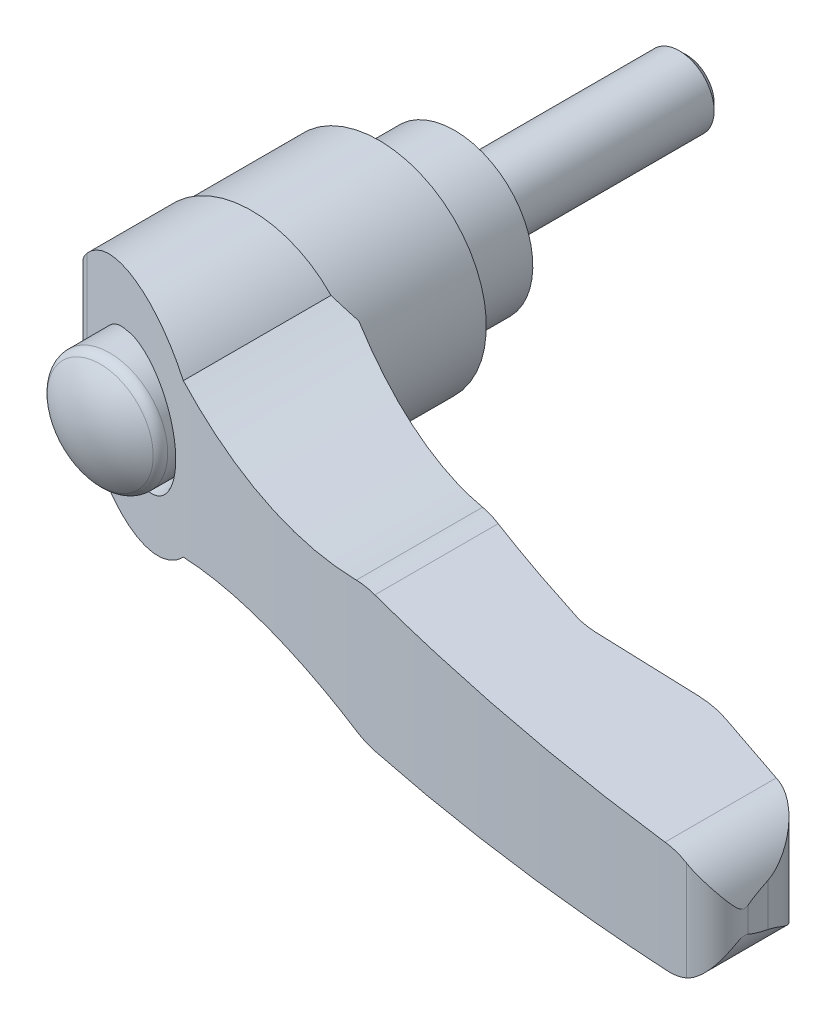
ISO-10303-21;
HEADER;
FILE_DESCRIPTION(('STEP AP214'),'2;1');
FILE_NAME('part.step','',(''),(''),'','','');
FILE_SCHEMA(('AUTOMOTIVE_DESIGN { 1 0 10303 214 1 1 1 1 }'));
ENDSEC;
DATA;
#1=APPLICATION_CONTEXT('core data for automotive mechanical design processes');
#2=APPLICATION_PROTOCOL_DEFINITION('international standard','automotive_design',2000,#1);
#3=PRODUCT_CONTEXT('',#1,'mechanical');
#4=PRODUCT('Part','Part','',(#3));
#5=PRODUCT_RELATED_PRODUCT_CATEGORY('part','',(#4));
#6=PRODUCT_DEFINITION_FORMATION('','',#4);
#7=PRODUCT_DEFINITION_CONTEXT('part definition',#1,'design');
#8=PRODUCT_DEFINITION('design','',#6,#7);
#9=PRODUCT_DEFINITION_SHAPE('','',#8);
#10=(LENGTH_UNIT() NAMED_UNIT(*) SI_UNIT(.MILLI.,.METRE.));
#11=(NAMED_UNIT(*) PLANE_ANGLE_UNIT() SI_UNIT($,.RADIAN.));
#12=(NAMED_UNIT(*) SI_UNIT($,.STERADIAN.) SOLID_ANGLE_UNIT());
#13=UNCERTAINTY_MEASURE_WITH_UNIT(LENGTH_MEASURE(1.E-05),#10,'distance_accuracy_value','');
#14=(GEOMETRIC_REPRESENTATION_CONTEXT(3) GLOBAL_UNCERTAINTY_ASSIGNED_CONTEXT((#13)) GLOBAL_UNIT_ASSIGNED_CONTEXT((#10,
#11,#12)) REPRESENTATION_CONTEXT('',''));
#15=CARTESIAN_POINT('',(0.,0.,0.));
#16=DIRECTION('',(0.,0.,1.));
#17=DIRECTION('',(1.,0.,0.));
#18=AXIS2_PLACEMENT_3D('',#15,#16,#17);
#19=CARTESIAN_POINT('',(0.,0.,-7.19325));
#20=DIRECTION('',(0.,0.,-1.));
#21=DIRECTION('',(0.,1.,0.));
#22=AXIS2_PLACEMENT_3D('',#19,#20,#21);
#23=CYLINDRICAL_SURFACE('',#22,3.);
#24=CARTESIAN_POINT('',(0.,0.,0.));
#25=DIRECTION('',(0.,0.,-1.));
#26=DIRECTION('',(0.,1.,0.));
#27=AXIS2_PLACEMENT_3D('',#24,#25,#26);
#28=CIRCLE('',#27,3.);
#29=CARTESIAN_POINT('',(0.,3.,0.));
#30=VERTEX_POINT('',#29);
#31=EDGE_CURVE('E17',#30,#30,#28,.F.);
#32=ORIENTED_EDGE('',*,*,#31,.F.);
#33=EDGE_LOOP('',(#32));
#34=FACE_BOUND('',#33,.T.);
#35=CARTESIAN_POINT('',(0.,0.,-19.3865000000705));
#36=DIRECTION('',(0.,0.,1.));
#37=DIRECTION('',(1.,0.,0.));
#38=AXIS2_PLACEMENT_3D('',#35,#36,#37);
#39=CIRCLE('',#38,3.);
#40=CARTESIAN_POINT('',(3.,0.,-19.3865000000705));
#41=VERTEX_POINT('',#40);
#42=EDGE_CURVE('E441',#41,#41,#39,.T.);
#43=ORIENTED_EDGE('',*,*,#42,.T.);
#44=EDGE_LOOP('',(#43));
#45=FACE_BOUND('',#44,.T.);
#46=ADVANCED_FACE('F14',(#34,#45),#23,.T.);
#47=CARTESIAN_POINT('',(4.875,0.,0.));
#48=DIRECTION('',(0.,0.,-1.));
#49=DIRECTION('',(0.,1.,0.));
#50=AXIS2_PLACEMENT_3D('',#47,#48,#49);
#51=PLANE('',#50);
#52=ORIENTED_EDGE('',*,*,#31,.T.);
#53=EDGE_LOOP('',(#52));
#54=FACE_BOUND('',#53,.T.);
#55=CARTESIAN_POINT('',(0.,0.,0.));
#56=DIRECTION('',(0.,0.,-1.));
#57=DIRECTION('',(0.,1.,0.));
#58=AXIS2_PLACEMENT_3D('',#55,#56,#57);
#59=CIRCLE('',#58,6.75);
#60=CARTESIAN_POINT('',(0.,6.75,0.));
#61=VERTEX_POINT('',#60);
#62=EDGE_CURVE('E194',#61,#61,#59,.F.);
#63=ORIENTED_EDGE('',*,*,#62,.F.);
#64=EDGE_LOOP('',(#63));
#65=FACE_BOUND('',#64,.T.);
#66=ADVANCED_FACE('F839',(#54,#65),#51,.T.);
#67=CARTESIAN_POINT('',(0.,0.,8.25));
#68=DIRECTION('',(0.,0.,-1.));
#69=DIRECTION('',(0.,1.,0.));
#70=AXIS2_PLACEMENT_3D('',#67,#68,#69);
#71=CYLINDRICAL_SURFACE('',#70,6.75);
#72=ORIENTED_EDGE('',*,*,#62,.T.);
#73=EDGE_LOOP('',(#72));
#74=FACE_BOUND('',#73,.T.);
#75=CARTESIAN_POINT('',(0.,0.,7.15000000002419));
#76=DIRECTION('',(0.,0.,-1.));
#77=DIRECTION('',(1.,0.,0.));
#78=AXIS2_PLACEMENT_3D('',#75,#76,#77);
#79=CIRCLE('',#78,6.74999999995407);
#80=CARTESIAN_POINT('',(6.74999999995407,0.,7.15000000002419));
#81=VERTEX_POINT('',#80);
#82=EDGE_CURVE('E192',#81,#81,#79,.T.);
#83=ORIENTED_EDGE('',*,*,#82,.T.);
#84=EDGE_LOOP('',(#83));
#85=FACE_BOUND('',#84,.T.);
#86=ADVANCED_FACE('F829',(#74,#85),#71,.T.);
#87=CARTESIAN_POINT('',(0.,0.,6.9000000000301));
#88=DIRECTION('',(0.,0.,-1.));
#89=DIRECTION('',(0.,1.,0.));
#90=AXIS2_PLACEMENT_3D('',#87,#88,#89);
#91=CONICAL_SURFACE('',#90,7.000000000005,0.785398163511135);
#92=ORIENTED_EDGE('',*,*,#82,.F.);
#93=EDGE_LOOP('',(#92));
#94=FACE_BOUND('',#93,.T.);
#95=CARTESIAN_POINT('',(0.,0.,6.9));
#96=DIRECTION('',(0.,0.,-1.));
#97=DIRECTION('',(0.,1.,0.));
#98=AXIS2_PLACEMENT_3D('',#95,#96,#97);
#99=CIRCLE('',#98,7.);
#100=CARTESIAN_POINT('',(0.,7.,6.9));
#101=VERTEX_POINT('',#100);
#102=EDGE_CURVE('E184',#101,#101,#99,.T.);
#103=ORIENTED_EDGE('',*,*,#102,.T.);
#104=EDGE_LOOP('',(#103));
#105=FACE_BOUND('',#104,.T.);
#106=ADVANCED_FACE('F819',(#94,#105),#91,.F.);
#107=CARTESIAN_POINT('',(0.,0.,6.2));
#108=DIRECTION('',(0.,0.,-1.));
#109=DIRECTION('',(0.,1.,0.));
#110=AXIS2_PLACEMENT_3D('',#107,#108,#109);
#111=CYLINDRICAL_SURFACE('',#110,7.);
#112=ORIENTED_EDGE('',*,*,#102,.F.);
#113=EDGE_LOOP('',(#112));
#114=FACE_BOUND('',#113,.T.);
#115=CARTESIAN_POINT('',(0.,0.,6.5));
#116=DIRECTION('',(0.,0.,-1.));
#117=DIRECTION('',(0.,1.,0.));
#118=AXIS2_PLACEMENT_3D('',#115,#116,#117);
#119=CIRCLE('',#118,7.);
#120=CARTESIAN_POINT('',(0.,7.,6.5));
#121=VERTEX_POINT('',#120);
#122=EDGE_CURVE('E181',#121,#121,#119,.F.);
#123=ORIENTED_EDGE('',*,*,#122,.F.);
#124=EDGE_LOOP('',(#123));
#125=FACE_BOUND('',#124,.T.);
#126=ADVANCED_FACE('F811',(#114,#125),#111,.F.);
#127=CARTESIAN_POINT('',(-9.01003775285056,-19.,6.5));
#128=DIRECTION('',(0.707106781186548,0.,0.707106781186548));
#129=DIRECTION('',(-0.707106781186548,0.,0.707106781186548));
#130=AXIS2_PLACEMENT_3D('',#127,#128,#129);
#131=PLANE('',#130);
#132=DIRECTION('',(0.,1.,0.));
#133=VECTOR('',#132,1.);
#134=CARTESIAN_POINT('',(-9.01003775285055,0.,6.5));
#135=LINE('',#134,#133);
#136=CARTESIAN_POINT('',(-9.01003775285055,-2.13584185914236,6.5));
#137=VERTEX_POINT('',#136);
#138=CARTESIAN_POINT('',(-9.01003775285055,2.13584185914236,6.5));
#139=VERTEX_POINT('',#138);
#140=EDGE_CURVE('E165',#137,#139,#135,.T.);
#141=ORIENTED_EDGE('',*,*,#140,.F.);
#142=CARTESIAN_POINT('',(-0.00999999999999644,0.,-2.50003775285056));
#143=DIRECTION('',(0.707106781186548,0.,0.707106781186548));
#144=DIRECTION('',(-0.707106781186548,0.,0.707106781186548));
#145=AXIS2_PLACEMENT_3D('',#142,#143,#144);
#146=ELLIPSE('',#145,13.0814754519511,9.25);
#147=EDGE_CURVE('E168',#139,#137,#146,.T.);
#148=ORIENTED_EDGE('',*,*,#147,.F.);
#149=EDGE_LOOP('',(#141,#148));
#150=FACE_BOUND('',#149,.T.);
#151=ADVANCED_FACE('F170',(#150),#131,.F.);
#152=CARTESIAN_POINT('',(-4.635,0.,6.5));
#153=DIRECTION('',(0.,0.,-1.));
#154=DIRECTION('',(0.,1.,0.));
#155=AXIS2_PLACEMENT_3D('',#152,#153,#154);
#156=PLANE('',#155);
#157=ORIENTED_EDGE('',*,*,#140,.T.);
#158=CARTESIAN_POINT('',(-0.00999999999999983,0.,6.5));
#159=DIRECTION('',(0.,0.,1.));
#160=DIRECTION('',(-1.,0.,0.));
#161=AXIS2_PLACEMENT_3D('',#158,#159,#160);
#162=CIRCLE('',#161,9.25);
#163=EDGE_CURVE('E172',#137,#139,#162,.T.);
#164=ORIENTED_EDGE('',*,*,#163,.F.);
#165=EDGE_LOOP('',(#157,#164));
#166=FACE_BOUND('',#165,.T.);
#167=ORIENTED_EDGE('',*,*,#122,.T.);
#168=EDGE_LOOP('',(#167));
#169=FACE_BOUND('',#168,.T.);
#170=ADVANCED_FACE('F179',(#166,#169),#156,.T.);
#171=CARTESIAN_POINT('',(-0.0100000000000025,0.,13.5625));
#172=DIRECTION('',(0.,0.,1.));
#173=DIRECTION('',(-1.,0.,0.));
#174=AXIS2_PLACEMENT_3D('',#171,#172,#173);
#175=CYLINDRICAL_SURFACE('',#174,9.25);
#176=ORIENTED_EDGE('',*,*,#163,.T.);
#177=ORIENTED_EDGE('',*,*,#147,.T.);
#178=EDGE_LOOP('',(#176,#177));
#179=FACE_BOUND('',#178,.T.);
#180=CARTESIAN_POINT('',(-0.010000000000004,0.,17.5));
#181=DIRECTION('',(0.,0.,1.));
#182=DIRECTION('',(-1.,0.,0.));
#183=AXIS2_PLACEMENT_3D('',#180,#181,#182);
#184=CIRCLE('',#183,9.25);
#185=CARTESIAN_POINT('',(-9.26,0.,17.5));
#186=VERTEX_POINT('',#185);
#187=CARTESIAN_POINT('',(9.23999999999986,0.,17.5000000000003));
#188=VERTEX_POINT('',#187);
#189=EDGE_CURVE('E419',#186,#188,#184,.T.);
#190=ORIENTED_EDGE('',*,*,#189,.F.);
#191=CARTESIAN_POINT('',(-0.010000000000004,0.,17.5));
#192=DIRECTION('',(0.,0.,1.));
#193=DIRECTION('',(-1.,0.,0.));
#194=AXIS2_PLACEMENT_3D('',#191,#192,#193);
#195=CIRCLE('',#194,9.25);
#196=EDGE_CURVE('E428',#188,#186,#195,.T.);
#197=ORIENTED_EDGE('',*,*,#196,.F.);
#198=EDGE_LOOP('',(#190,#197));
#199=FACE_BOUND('',#198,.T.);
#200=ADVANCED_FACE('F174',(#179,#199),#175,.T.);
#201=CARTESIAN_POINT('',(0.,0.,24.));
#202=DIRECTION('',(1.,0.,0.));
#203=DIRECTION('',(0.,0.,1.));
#204=AXIS2_PLACEMENT_3D('',#201,#202,#203);
#205=SPHERICAL_SURFACE('',#204,8.);
#206=CARTESIAN_POINT('',(0.,0.,30.5652144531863));
#207=DIRECTION('',(0.,0.,1.));
#208=DIRECTION('',(0.,-1.,0.));
#209=AXIS2_PLACEMENT_3D('',#206,#207,#208);
#210=CIRCLE('',#209,4.57142857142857);
#211=CARTESIAN_POINT('',(0.,-4.57142857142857,30.5652144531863));
#212=VERTEX_POINT('',#211);
#213=EDGE_CURVE('E403',#212,#212,#210,.F.);
#214=ORIENTED_EDGE('',*,*,#213,.F.);
#215=EDGE_LOOP('',(#214));
#216=FACE_BOUND('',#215,.T.);
#217=ADVANCED_FACE('F778',(#216),#205,.T.);
#218=CARTESIAN_POINT('',(64.6274051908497,-10.5,37.5817950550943));
#219=DIRECTION('',(0.992331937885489,0.,-0.123601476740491));
#220=DIRECTION('',(0.123601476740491,0.,0.992331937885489));
#221=AXIS2_PLACEMENT_3D('',#218,#219,#220);
#222=PLANE('',#221);
#223=CARTESIAN_POINT('',(60.25,0.,2.43788666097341));
#224=DIRECTION('',(0.992331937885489,0.,-0.123601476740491));
#225=DIRECTION('',(0.123601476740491,0.,0.992331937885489));
#226=AXIS2_PLACEMENT_3D('',#223,#224,#225);
#227=ELLIPSE('',#226,38.4299615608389,4.75);
#228=CARTESIAN_POINT('',(64.8745408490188,1.08449155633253,39.5659186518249));
#229=VERTEX_POINT('',#228);
#230=CARTESIAN_POINT('',(64.6274051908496,1.84413226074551,37.5817950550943));
#231=VERTEX_POINT('',#230);
#232=EDGE_CURVE('E555',#229,#231,#227,.F.);
#233=ORIENTED_EDGE('',*,*,#232,.F.);
#234=DIRECTION('',(0.,-1.,0.));
#235=VECTOR('',#234,1.);
#236=CARTESIAN_POINT('',(64.8745408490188,-10.5,39.5659186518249));
#237=LINE('',#236,#235);
#238=CARTESIAN_POINT('',(64.8745408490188,-1.08449155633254,39.5659186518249));
#239=VERTEX_POINT('',#238);
#240=EDGE_CURVE('E495',#239,#229,#237,.F.);
#241=ORIENTED_EDGE('',*,*,#240,.F.);
#242=CARTESIAN_POINT('',(60.25,0.,2.43788666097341));
#243=DIRECTION('',(0.992331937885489,0.,-0.123601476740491));
#244=DIRECTION('',(0.123601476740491,0.,0.992331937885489));
#245=AXIS2_PLACEMENT_3D('',#242,#243,#244);
#246=ELLIPSE('',#245,38.4299615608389,4.75);
#247=CARTESIAN_POINT('',(64.6274051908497,-1.84413226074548,37.5817950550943));
#248=VERTEX_POINT('',#247);
#249=EDGE_CURVE('E504',#248,#239,#246,.F.);
#250=ORIENTED_EDGE('',*,*,#249,.F.);
#251=DIRECTION('',(0.,-1.,0.));
#252=VECTOR('',#251,1.);
#253=CARTESIAN_POINT('',(64.6274051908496,-10.5,37.5817950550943));
#254=LINE('',#253,#252);
#255=EDGE_CURVE('E177',#231,#248,#254,.T.);
#256=ORIENTED_EDGE('',*,*,#255,.F.);
#257=EDGE_LOOP('',(#233,#241,#250,#256));
#258=FACE_BOUND('',#257,.T.);
#259=ADVANCED_FACE('F543',(#258),#222,.T.);
#260=CARTESIAN_POINT('',(58.6337202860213,-10.5,38.3283479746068));
#261=DIRECTION('',(0.,-1.,0.));
#262=DIRECTION('',(1.,0.,0.));
#263=AXIS2_PLACEMENT_3D('',#260,#261,#262);
#264=CYLINDRICAL_SURFACE('',#263,6.04);
#265=CARTESIAN_POINT('',(64.6274051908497,1.84413226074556,37.5817950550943));
#266=CARTESIAN_POINT('',(64.6175868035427,1.86745330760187,37.5030045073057));
#267=CARTESIAN_POINT('',(64.6063375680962,1.89362327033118,37.4253204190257));
#268=CARTESIAN_POINT('',(64.5811702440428,1.95049016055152,37.2721928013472));
#269=CARTESIAN_POINT('',(64.5672561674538,1.98118026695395,37.1967460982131));
#270=CARTESIAN_POINT('',(64.5369883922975,2.04585034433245,37.0482136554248));
#271=CARTESIAN_POINT('',(64.520645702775,2.07981523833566,36.9751189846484));
#272=CARTESIAN_POINT('',(64.4855821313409,2.15032519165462,36.8307396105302));
#273=CARTESIAN_POINT('',(64.4668602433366,2.18687133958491,36.7594556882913));
#274=CARTESIAN_POINT('',(64.4072221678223,2.29938724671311,36.547961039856));
#275=CARTESIAN_POINT('',(64.3628565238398,2.37818379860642,36.410218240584));
#276=CARTESIAN_POINT('',(64.2652007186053,2.53960895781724,36.1400450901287));
#277=CARTESIAN_POINT('',(64.2118976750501,2.6222429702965,36.007622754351));
#278=CARTESIAN_POINT('',(64.077119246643,2.81672317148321,35.7040219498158));
#279=CARTESIAN_POINT('',(63.9921849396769,2.92909268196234,35.5347005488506));
#280=CARTESIAN_POINT('',(63.8063278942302,3.15216626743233,35.2039790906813));
#281=CARTESIAN_POINT('',(63.7054078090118,3.26287061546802,35.0425777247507));
#282=CARTESIAN_POINT('',(63.4870671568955,3.47959027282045,34.7278934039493));
#283=CARTESIAN_POINT('',(63.369645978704,3.58560540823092,34.5746107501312));
#284=CARTESIAN_POINT('',(63.1179209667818,3.78996521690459,34.277236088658));
#285=CARTESIAN_POINT('',(62.9836257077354,3.88831374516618,34.1331394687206));
#286=CARTESIAN_POINT('',(62.6561598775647,4.10136712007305,33.815313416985));
#287=CARTESIAN_POINT('',(62.4571888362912,4.21258905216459,33.6450495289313));
#288=CARTESIAN_POINT('',(62.1378586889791,4.36029911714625,33.4069452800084));
#289=CARTESIAN_POINT('',(62.0281124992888,4.40629516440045,33.3305585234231));
#290=CARTESIAN_POINT('',(61.8018114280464,4.49098569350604,33.1841350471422));
#291=CARTESIAN_POINT('',(61.6852609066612,4.52968478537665,33.1140943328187));
#292=CARTESIAN_POINT('',(61.4786111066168,4.58924867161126,32.9993621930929));
#293=CARTESIAN_POINT('',(61.3900115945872,4.61209493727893,32.9529824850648));
#294=CARTESIAN_POINT('',(61.2097340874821,4.65295056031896,32.8642982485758));
#295=CARTESIAN_POINT('',(61.1180570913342,4.67096147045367,32.82199241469));
#296=CARTESIAN_POINT('',(60.9313596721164,4.70183469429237,32.7415027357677));
#297=CARTESIAN_POINT('',(60.8363219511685,4.71466416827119,32.7033462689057));
#298=CARTESIAN_POINT('',(60.6438287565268,4.73463763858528,32.631712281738));
#299=CARTESIAN_POINT('',(60.5463713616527,4.74177695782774,32.5982386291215));
#300=CARTESIAN_POINT('',(60.4479724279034,4.74587261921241,32.5672639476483));
#301=B_SPLINE_CURVE_WITH_KNOTS('',3,(#265,#266,#267,#268,#269,#270,#271,#272,#273,#274,#275,
#276,#277,#278,#279,#280,#281,#282,#283,#284,#285,#286,#287,#288,#289,#290,#291,#292,#293,#294,
#295,#296,#297,#298,#299,#300),.UNSPECIFIED.,.F.,.F.,(4,2,2,2,2,2,2,2,2,2,2,2,2,2,2,2,2,4),(0.,
0.248076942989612,0.495783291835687,0.742399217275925,0.989119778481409,1.48293160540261,
1.97746142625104,2.63745339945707,3.29733594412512,3.95724294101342,4.61681594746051,
5.46693586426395,5.89075482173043,6.31430511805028,6.62183365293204,6.92926331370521,
7.23861197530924,7.54821464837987),.UNSPECIFIED.);
#302=CARTESIAN_POINT('',(60.4479724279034,4.74587261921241,32.5672639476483));
#303=VERTEX_POINT('',#302);
#304=EDGE_CURVE('E494',#231,#303,#301,.T.);
#305=ORIENTED_EDGE('',*,*,#304,.F.);
#306=ORIENTED_EDGE('',*,*,#255,.T.);
#307=CARTESIAN_POINT('',(60.4479724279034,-4.74587261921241,32.5672639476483));
#308=CARTESIAN_POINT('',(60.5755504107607,-4.74057354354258,32.6074069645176));
#309=CARTESIAN_POINT('',(60.7015088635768,-4.73014540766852,32.6517620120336));
#310=CARTESIAN_POINT('',(60.9490652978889,-4.69992242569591,32.7481786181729));
#311=CARTESIAN_POINT('',(61.0706698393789,-4.6801423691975,32.8002279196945));
#312=CARTESIAN_POINT('',(61.3074659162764,-4.63235500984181,32.9108206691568));
#313=CARTESIAN_POINT('',(61.4227141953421,-4.60444273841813,32.9692844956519));
#314=CARTESIAN_POINT('',(61.6477173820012,-4.54120548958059,33.0925213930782));
#315=CARTESIAN_POINT('',(61.7574696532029,-4.50587699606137,33.1572974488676));
#316=CARTESIAN_POINT('',(61.9940137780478,-4.42040174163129,33.307032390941));
#317=CARTESIAN_POINT('',(62.1193938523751,-4.36870213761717,33.3933358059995));
#318=CARTESIAN_POINT('',(62.3610721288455,-4.25718277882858,33.5732278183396));
#319=CARTESIAN_POINT('',(62.4773638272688,-4.19735729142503,33.6668215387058));
#320=CARTESIAN_POINT('',(62.7012840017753,-4.07066877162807,33.8608437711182));
#321=CARTESIAN_POINT('',(62.8088611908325,-4.0037687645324,33.9613071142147));
#322=CARTESIAN_POINT('',(63.0146476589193,-3.86453813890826,34.1677809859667));
#323=CARTESIAN_POINT('',(63.1128596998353,-3.79220913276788,34.2737898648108));
#324=CARTESIAN_POINT('',(63.3331746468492,-3.61700510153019,34.5290929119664));
#325=CARTESIAN_POINT('',(63.4514763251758,-3.51235864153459,34.6804594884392));
#326=CARTESIAN_POINT('',(63.6718053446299,-3.29808480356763,34.9913387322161));
#327=CARTESIAN_POINT('',(63.7738256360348,-3.18845529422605,35.1508548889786));
#328=CARTESIAN_POINT('',(63.961662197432,-2.9676568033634,35.4770445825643));
#329=CARTESIAN_POINT('',(64.0475378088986,-2.85649513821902,35.6436890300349));
#330=CARTESIAN_POINT('',(64.2038484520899,-2.63586419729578,35.9851508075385));
#331=CARTESIAN_POINT('',(64.2742871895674,-2.52639452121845,36.1599661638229));
#332=CARTESIAN_POINT('',(64.3705847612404,-2.36382517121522,36.4361542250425));
#333=CARTESIAN_POINT('',(64.4019853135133,-2.30809068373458,36.5340606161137));
#334=CARTESIAN_POINT('',(64.4601539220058,-2.20019362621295,36.7330390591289));
#335=CARTESIAN_POINT('',(64.4869269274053,-2.14802727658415,36.8341075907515));
#336=CARTESIAN_POINT('',(64.5357331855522,-2.04890785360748,37.0402846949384));
#337=CARTESIAN_POINT('',(64.5577546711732,-2.00196785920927,37.1454025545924));
#338=CARTESIAN_POINT('',(64.596614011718,-1.91618262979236,37.360168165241));
#339=CARTESIAN_POINT('',(64.6134353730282,-1.87736327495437,37.4698291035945));
#340=CARTESIAN_POINT('',(64.6274051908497,-1.84413226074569,37.5817950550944));
#341=B_SPLINE_CURVE_WITH_KNOTS('',3,(#307,#308,#309,#310,#311,#312,#313,#314,#315,#316,#317,
#318,#319,#320,#321,#322,#323,#324,#325,#326,#327,#328,#329,#330,#331,#332,#333,#334,#335,#336,
#337,#338,#339,#340),.UNSPECIFIED.,.F.,.F.,(4,2,2,2,2,2,2,2,2,2,2,2,2,2,2,2,4),(0.,
0.401264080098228,0.801895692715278,1.19802151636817,1.59433557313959,2.0758833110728,
2.55777255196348,3.04231807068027,3.52672024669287,4.18208013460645,4.83772302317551,
5.49090678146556,6.1439335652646,6.49464389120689,6.84497677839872,7.19616755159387,
7.54846105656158),.UNSPECIFIED.);
#342=CARTESIAN_POINT('',(60.4479724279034,-4.74587261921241,32.5672639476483));
#343=VERTEX_POINT('',#342);
#344=EDGE_CURVE('E507',#343,#248,#341,.T.);
#345=ORIENTED_EDGE('',*,*,#344,.F.);
#346=DIRECTION('',(0.,-1.,0.));
#347=VECTOR('',#346,1.);
#348=CARTESIAN_POINT('',(60.4479724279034,-10.5,32.5672639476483));
#349=LINE('',#348,#347);
#350=EDGE_CURVE('E417',#303,#343,#349,.T.);
#351=ORIENTED_EDGE('',*,*,#350,.F.);
#352=EDGE_LOOP('',(#305,#306,#345,#351));
#353=FACE_BOUND('',#352,.T.);
#354=ADVANCED_FACE('F537',(#353),#264,.T.);
#355=CARTESIAN_POINT('',(-9.26,-10.5,17.5));
#356=DIRECTION('',(0.,0.,-1.));
#357=DIRECTION('',(0.,1.,0.));
#358=AXIS2_PLACEMENT_3D('',#355,#356,#357);
#359=PLANE('',#358);
#360=DIRECTION('',(0.,-1.,0.));
#361=VECTOR('',#360,1.);
#362=CARTESIAN_POINT('',(-9.26,-10.5,17.5));
#363=LINE('',#362,#361);
#364=CARTESIAN_POINT('',(-9.26,2.12188595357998,17.5));
#365=VERTEX_POINT('',#364);
#366=EDGE_CURVE('E426',#365,#186,#363,.T.);
#367=ORIENTED_EDGE('',*,*,#366,.F.);
#368=CARTESIAN_POINT('',(0.,0.,17.5));
#369=DIRECTION('',(0.,0.,1.));
#370=DIRECTION('',(0.,-1.,0.));
#371=AXIS2_PLACEMENT_3D('',#368,#369,#370);
#372=CIRCLE('',#371,9.5);
#373=CARTESIAN_POINT('',(6.84374087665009,6.58887022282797,17.5));
#374=VERTEX_POINT('',#373);
#375=EDGE_CURVE('E340',#374,#365,#372,.T.);
#376=ORIENTED_EDGE('',*,*,#375,.F.);
#377=CARTESIAN_POINT('',(19.25,44.09,17.5));
#378=DIRECTION('',(0.,0.,1.));
#379=DIRECTION('',(0.,-1.,0.));
#380=AXIS2_PLACEMENT_3D('',#377,#378,#379);
#381=CIRCLE('',#380,39.5);
#382=CARTESIAN_POINT('',(9.23999999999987,5.8794006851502,17.5000000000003));
#383=VERTEX_POINT('',#382);
#384=EDGE_CURVE('E300',#374,#383,#381,.T.);
#385=ORIENTED_EDGE('',*,*,#384,.T.);
#386=DIRECTION('',(0.,-1.,0.));
#387=VECTOR('',#386,1.);
#388=CARTESIAN_POINT('',(9.23999999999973,-10.5,17.5000000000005));
#389=LINE('',#388,#387);
#390=EDGE_CURVE('E406',#383,#188,#389,.T.);
#391=ORIENTED_EDGE('',*,*,#390,.T.);
#392=ORIENTED_EDGE('',*,*,#196,.T.);
#393=EDGE_LOOP('',(#367,#376,#385,#391,#392));
#394=FACE_BOUND('',#393,.T.);
#395=ADVANCED_FACE('F542',(#394),#359,.T.);
#396=CARTESIAN_POINT('',(-9.26,-10.5,21.2038249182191));
#397=DIRECTION('',(-1.,0.,0.));
#398=DIRECTION('',(0.,-1.,0.));
#399=AXIS2_PLACEMENT_3D('',#396,#397,#398);
#400=PLANE('',#399);
#401=ORIENTED_EDGE('',*,*,#366,.T.);
#402=DIRECTION('',(0.,1.,0.));
#403=VECTOR('',#402,1.);
#404=CARTESIAN_POINT('',(-9.26,-10.5,17.5));
#405=LINE('',#404,#403);
#406=CARTESIAN_POINT('',(-9.26,-2.12188595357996,17.5));
#407=VERTEX_POINT('',#406);
#408=EDGE_CURVE('E420',#407,#186,#405,.T.);
#409=ORIENTED_EDGE('',*,*,#408,.F.);
#410=DIRECTION('',(0.,0.,1.));
#411=VECTOR('',#410,1.);
#412=CARTESIAN_POINT('',(-9.26,-2.12188595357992,42.5));
#413=LINE('',#412,#411);
#414=CARTESIAN_POINT('',(-9.26,-2.12188595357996,21.2038249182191));
#415=VERTEX_POINT('',#414);
#416=EDGE_CURVE('E423',#415,#407,#413,.F.);
#417=ORIENTED_EDGE('',*,*,#416,.F.);
#418=DIRECTION('',(0.,-1.,0.));
#419=VECTOR('',#418,1.);
#420=CARTESIAN_POINT('',(-9.26,-10.5,21.2038249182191));
#421=LINE('',#420,#419);
#422=CARTESIAN_POINT('',(-9.26,2.12188595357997,21.2038249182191));
#423=VERTEX_POINT('',#422);
#424=EDGE_CURVE('E475',#423,#415,#421,.T.);
#425=ORIENTED_EDGE('',*,*,#424,.F.);
#426=DIRECTION('',(0.,0.,1.));
#427=VECTOR('',#426,1.);
#428=CARTESIAN_POINT('',(-9.26,2.12188595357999,42.5));
#429=LINE('',#428,#427);
#430=EDGE_CURVE('E343',#365,#423,#429,.T.);
#431=ORIENTED_EDGE('',*,*,#430,.F.);
#432=EDGE_LOOP('',(#401,#409,#417,#425,#431));
#433=FACE_BOUND('',#432,.T.);
#434=ADVANCED_FACE('F740',(#433),#400,.T.);
#435=CARTESIAN_POINT('',(-9.26,-10.5,17.5));
#436=DIRECTION('',(0.,0.,-1.));
#437=DIRECTION('',(0.,1.,0.));
#438=AXIS2_PLACEMENT_3D('',#435,#436,#437);
#439=PLANE('',#438);
#440=DIRECTION('',(0.,-1.,0.));
#441=VECTOR('',#440,1.);
#442=CARTESIAN_POINT('',(9.23999999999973,-10.5,17.5000000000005));
#443=LINE('',#442,#441);
#444=CARTESIAN_POINT('',(9.23999999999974,-5.87940068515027,17.5000000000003));
#445=VERTEX_POINT('',#444);
#446=EDGE_CURVE('E404',#188,#445,#443,.T.);
#447=ORIENTED_EDGE('',*,*,#446,.T.);
#448=CARTESIAN_POINT('',(19.25,-44.09,17.5));
#449=DIRECTION('',(0.,0.,1.));
#450=DIRECTION('',(0.,-1.,0.));
#451=AXIS2_PLACEMENT_3D('',#448,#449,#450);
#452=CIRCLE('',#451,39.5);
#453=CARTESIAN_POINT('',(6.84374087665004,-6.588870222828,17.5));
#454=VERTEX_POINT('',#453);
#455=EDGE_CURVE('E474',#445,#454,#452,.T.);
#456=ORIENTED_EDGE('',*,*,#455,.T.);
#457=CARTESIAN_POINT('',(0.,0.,17.5));
#458=DIRECTION('',(0.,0.,1.));
#459=DIRECTION('',(0.,-1.,0.));
#460=AXIS2_PLACEMENT_3D('',#457,#458,#459);
#461=CIRCLE('',#460,9.5);
#462=EDGE_CURVE('E478',#407,#454,#461,.T.);
#463=ORIENTED_EDGE('',*,*,#462,.F.);
#464=ORIENTED_EDGE('',*,*,#408,.T.);
#465=ORIENTED_EDGE('',*,*,#189,.T.);
#466=EDGE_LOOP('',(#447,#456,#463,#464,#465));
#467=FACE_BOUND('',#466,.T.);
#468=ADVANCED_FACE('F732',(#467),#439,.T.);
#469=CARTESIAN_POINT('',(53.8294507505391,-10.5,30.4829917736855));
#470=DIRECTION('',(0.300372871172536,0.,-0.95382185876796));
#471=DIRECTION('',(0.95382185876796,0.,0.300372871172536));
#472=AXIS2_PLACEMENT_3D('',#469,#470,#471);
#473=PLANE('',#472);
#474=CARTESIAN_POINT('',(60.25,0.,32.5049194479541));
#475=DIRECTION('',(0.300372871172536,0.,-0.95382185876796));
#476=DIRECTION('',(0.95382185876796,0.,0.300372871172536));
#477=AXIS2_PLACEMENT_3D('',#474,#475,#476);
#478=ELLIPSE('',#477,4.97996555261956,4.75);
#479=CARTESIAN_POINT('',(60.25,4.75,32.5049194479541));
#480=VERTEX_POINT('',#479);
#481=EDGE_CURVE('E496',#303,#480,#478,.F.);
#482=ORIENTED_EDGE('',*,*,#481,.F.);
#483=ORIENTED_EDGE('',*,*,#350,.T.);
#484=CARTESIAN_POINT('',(60.25,0.,32.5049194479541));
#485=DIRECTION('',(0.300372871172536,0.,-0.95382185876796));
#486=DIRECTION('',(0.95382185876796,0.,0.300372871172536));
#487=AXIS2_PLACEMENT_3D('',#484,#485,#486);
#488=ELLIPSE('',#487,4.97996555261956,4.75);
#489=CARTESIAN_POINT('',(60.25,-4.75,32.5049194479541));
#490=VERTEX_POINT('',#489);
#491=EDGE_CURVE('E536',#490,#343,#488,.F.);
#492=ORIENTED_EDGE('',*,*,#491,.F.);
#493=DIRECTION('',(-0.953255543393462,-0.0344545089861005,-0.300194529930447));
#494=VECTOR('',#493,1.);
#495=CARTESIAN_POINT('',(60.25,-4.75,32.5049194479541));
#496=LINE('',#495,#494);
#497=CARTESIAN_POINT('',(53.8294507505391,-4.98206460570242,30.4829917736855));
#498=VERTEX_POINT('',#497);
#499=EDGE_CURVE('E464',#490,#498,#496,.T.);
#500=ORIENTED_EDGE('',*,*,#499,.T.);
#501=DIRECTION('',(0.,-1.,0.));
#502=VECTOR('',#501,1.);
#503=CARTESIAN_POINT('',(53.8294507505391,-10.5,30.4829917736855));
#504=LINE('',#503,#502);
#505=CARTESIAN_POINT('',(53.8294507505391,4.98206460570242,30.4829917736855));
#506=VERTEX_POINT('',#505);
#507=EDGE_CURVE('E414',#506,#498,#504,.T.);
#508=ORIENTED_EDGE('',*,*,#507,.F.);
#509=DIRECTION('',(0.953255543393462,-0.0344545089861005,0.300194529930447));
#510=VECTOR('',#509,1.);
#511=CARTESIAN_POINT('',(53.8294507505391,4.98206460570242,30.4829917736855));
#512=LINE('',#511,#510);
#513=EDGE_CURVE('E299',#506,#480,#512,.T.);
#514=ORIENTED_EDGE('',*,*,#513,.T.);
#515=EDGE_LOOP('',(#482,#483,#492,#500,#508,#514));
#516=FACE_BOUND('',#515,.T.);
#517=ADVANCED_FACE('F573',(#516),#473,.T.);
#518=CARTESIAN_POINT('',(51.0780352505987,-10.5,39.22));
#519=DIRECTION('',(0.,-1.,0.));
#520=DIRECTION('',(1.,0.,0.));
#521=AXIS2_PLACEMENT_3D('',#518,#519,#520);
#522=CYLINDRICAL_SURFACE('',#521,9.15999999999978);
#523=CARTESIAN_POINT('',(51.0780352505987,5.08151188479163,39.22));
#524=DIRECTION('',(-0.0361204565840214,-0.999347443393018,0.));
#525=DIRECTION('',(0.999347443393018,-0.0361204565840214,0.));
#526=AXIS2_PLACEMENT_3D('',#523,#524,#525);
#527=ELLIPSE('',#526,9.16598132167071,9.15999999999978);
#528=CARTESIAN_POINT('',(51.0780352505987,5.08151188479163,30.06));
#529=VERTEX_POINT('',#528);
#530=EDGE_CURVE('E302',#529,#506,#527,.T.);
#531=ORIENTED_EDGE('',*,*,#530,.T.);
#532=ORIENTED_EDGE('',*,*,#507,.T.);
#533=CARTESIAN_POINT('',(51.0780352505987,-5.08151188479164,39.22));
#534=DIRECTION('',(-0.0361204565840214,0.999347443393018,0.));
#535=DIRECTION('',(-0.999347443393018,-0.0361204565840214,0.));
#536=AXIS2_PLACEMENT_3D('',#533,#534,#535);
#537=ELLIPSE('',#536,9.16598132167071,9.15999999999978);
#538=CARTESIAN_POINT('',(51.0780352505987,-5.08151188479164,30.06));
#539=VERTEX_POINT('',#538);
#540=EDGE_CURVE('E463',#498,#539,#537,.T.);
#541=ORIENTED_EDGE('',*,*,#540,.T.);
#542=DIRECTION('',(0.,1.,0.));
#543=VECTOR('',#542,1.);
#544=CARTESIAN_POINT('',(51.0780352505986,-10.5,30.06));
#545=LINE('',#544,#543);
#546=EDGE_CURVE('E411',#529,#539,#545,.F.);
#547=ORIENTED_EDGE('',*,*,#546,.F.);
#548=EDGE_LOOP('',(#531,#532,#541,#547));
#549=FACE_BOUND('',#548,.T.);
#550=ADVANCED_FACE('F716',(#549),#522,.T.);
#551=CARTESIAN_POINT('',(42.239481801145,-10.5,30.06));
#552=DIRECTION('',(0.,0.,-1.));
#553=DIRECTION('',(0.,1.,0.));
#554=AXIS2_PLACEMENT_3D('',#551,#552,#553);
#555=PLANE('',#554);
#556=DIRECTION('',(0.999347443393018,-0.0361204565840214,0.));
#557=VECTOR('',#556,1.);
#558=CARTESIAN_POINT('',(30.3472861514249,5.83080496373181,30.06));
#559=LINE('',#558,#557);
#560=CARTESIAN_POINT('',(42.239481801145,5.4009729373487,30.06));
#561=VERTEX_POINT('',#560);
#562=EDGE_CURVE('E488',#561,#529,#559,.T.);
#563=ORIENTED_EDGE('',*,*,#562,.T.);
#564=ORIENTED_EDGE('',*,*,#546,.T.);
#565=DIRECTION('',(-0.999347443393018,-0.0361204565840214,0.));
#566=VECTOR('',#565,1.);
#567=CARTESIAN_POINT('',(60.25,-4.75,30.06));
#568=LINE('',#567,#566);
#569=CARTESIAN_POINT('',(42.239481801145,-5.4009729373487,30.06));
#570=VERTEX_POINT('',#569);
#571=EDGE_CURVE('E460',#539,#570,#568,.T.);
#572=ORIENTED_EDGE('',*,*,#571,.T.);
#573=DIRECTION('',(0.,-1.,0.));
#574=VECTOR('',#573,1.);
#575=CARTESIAN_POINT('',(42.239481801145,-10.5,30.06));
#576=LINE('',#575,#574);
#577=EDGE_CURVE('E409',#570,#561,#576,.F.);
#578=ORIENTED_EDGE('',*,*,#577,.T.);
#579=EDGE_LOOP('',(#563,#564,#572,#578));
#580=FACE_BOUND('',#579,.T.);
#581=ADVANCED_FACE('F708',(#580),#555,.T.);
#582=CARTESIAN_POINT('',(42.2394818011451,-10.5,23.0799999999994));
#583=DIRECTION('',(0.,-1.,0.));
#584=DIRECTION('',(1.,0.,0.));
#585=AXIS2_PLACEMENT_3D('',#582,#583,#584);
#586=CYLINDRICAL_SURFACE('',#585,6.98000000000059);
#587=DIRECTION('',(0.,-1.,0.));
#588=VECTOR('',#587,1.);
#589=CARTESIAN_POINT('',(40.3024609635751,-10.5,29.785844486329));
#590=LINE('',#589,#588);
#591=CARTESIAN_POINT('',(40.3024609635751,-5.47098470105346,29.7858444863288));
#592=VERTEX_POINT('',#591);
#593=CARTESIAN_POINT('',(40.3024609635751,5.47098470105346,29.7858444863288));
#594=VERTEX_POINT('',#593);
#595=EDGE_CURVE('E401',#592,#594,#590,.F.);
#596=ORIENTED_EDGE('',*,*,#595,.T.);
#597=CARTESIAN_POINT('',(42.2394818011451,5.40097293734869,23.0799999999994));
#598=DIRECTION('',(-0.0361204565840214,-0.999347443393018,0.));
#599=DIRECTION('',(0.999347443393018,-0.0361204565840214,0.));
#600=AXIS2_PLACEMENT_3D('',#597,#598,#599);
#601=ELLIPSE('',#600,6.98455781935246,6.98000000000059);
#602=EDGE_CURVE('E491',#594,#561,#601,.F.);
#603=ORIENTED_EDGE('',*,*,#602,.T.);
#604=ORIENTED_EDGE('',*,*,#577,.F.);
#605=CARTESIAN_POINT('',(42.2394818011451,-5.4009729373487,23.0799999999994));
#606=DIRECTION('',(-0.0361204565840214,0.999347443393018,0.));
#607=DIRECTION('',(-0.999347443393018,-0.0361204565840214,0.));
#608=AXIS2_PLACEMENT_3D('',#605,#606,#607);
#609=ELLIPSE('',#608,6.98455781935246,6.98000000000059);
#610=EDGE_CURVE('E462',#570,#592,#609,.F.);
#611=ORIENTED_EDGE('',*,*,#610,.T.);
#612=EDGE_LOOP('',(#596,#603,#604,#611));
#613=FACE_BOUND('',#612,.T.);
#614=ADVANCED_FACE('F310',(#613),#586,.F.);
#615=CARTESIAN_POINT('',(88.9416647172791,-10.5,-138.600024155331));
#616=DIRECTION('',(0.,-1.,0.));
#617=DIRECTION('',(1.,0.,0.));
#618=AXIS2_PLACEMENT_3D('',#615,#616,#617);
#619=CYLINDRICAL_SURFACE('',#618,175.27);
#620=CARTESIAN_POINT('',(30.3472861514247,5.83080496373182,26.5855433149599));
#621=CARTESIAN_POINT('',(30.1696679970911,5.83722947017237,26.5225405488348));
#622=CARTESIAN_POINT('',(29.9919650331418,5.83772087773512,26.45918181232));
#623=CARTESIAN_POINT('',(29.6377732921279,5.82691956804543,26.3322542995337));
#624=CARTESIAN_POINT('',(29.461282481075,5.81567269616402,26.2686872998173));
#625=CARTESIAN_POINT('',(29.1095062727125,5.78152581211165,26.1413510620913));
#626=CARTESIAN_POINT('',(28.9342208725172,5.75862582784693,26.0775818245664));
#627=CARTESIAN_POINT('',(28.5848474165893,5.70116062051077,25.9498538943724));
#628=CARTESIAN_POINT('',(28.4107667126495,5.6665501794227,25.8858954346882));
#629=CARTESIAN_POINT('',(28.2379732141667,5.62616845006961,25.8220994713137));
#630=B_SPLINE_CURVE_WITH_KNOTS('',3,(#620,#621,#622,#623,#624,#625,#626,#627,#628,#629),
.UNSPECIFIED.,.F.,.F.,(4,2,2,2,4),(0.,0.565613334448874,1.1290258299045,1.69243697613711,
2.2580489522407),.UNSPECIFIED.);
#631=CARTESIAN_POINT('',(30.3472861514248,5.83080496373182,26.5855433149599));
#632=VERTEX_POINT('',#631);
#633=CARTESIAN_POINT('',(28.2379732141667,5.62616845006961,25.8220994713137));
#634=VERTEX_POINT('',#633);
#635=EDGE_CURVE('E290',#632,#634,#630,.T.);
#636=ORIENTED_EDGE('',*,*,#635,.F.);
#637=CARTESIAN_POINT('',(88.9416647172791,3.71296724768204,-138.600024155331));
#638=DIRECTION('',(-0.0361204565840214,-0.999347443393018,0.));
#639=DIRECTION('',(0.999347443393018,-0.0361204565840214,0.));
#640=AXIS2_PLACEMENT_3D('',#637,#638,#639);
#641=ELLIPSE('',#640,175.384448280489,175.27);
#642=EDGE_CURVE('E493',#632,#594,#641,.F.);
#643=ORIENTED_EDGE('',*,*,#642,.T.);
#644=ORIENTED_EDGE('',*,*,#595,.F.);
#645=CARTESIAN_POINT('',(88.9416647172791,-3.71296724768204,-138.600024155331));
#646=DIRECTION('',(-0.0361204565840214,0.999347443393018,0.));
#647=DIRECTION('',(-0.999347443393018,-0.0361204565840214,0.));
#648=AXIS2_PLACEMENT_3D('',#645,#646,#647);
#649=ELLIPSE('',#648,175.384448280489,175.27);
#650=CARTESIAN_POINT('',(30.3472861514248,-5.83080496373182,26.5855433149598));
#651=VERTEX_POINT('',#650);
#652=EDGE_CURVE('E396',#592,#651,#649,.F.);
#653=ORIENTED_EDGE('',*,*,#652,.T.);
#654=CARTESIAN_POINT('',(28.237973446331,-5.6261685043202,25.8220995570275));
#655=CARTESIAN_POINT('',(28.4107669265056,-5.66655022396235,25.8858955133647));
#656=CARTESIAN_POINT('',(28.584847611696,-5.70116065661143,25.9498539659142));
#657=CARTESIAN_POINT('',(28.9342210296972,-5.75862584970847,26.0775818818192));
#658=CARTESIAN_POINT('',(29.1095064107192,-5.78152582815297,26.1413511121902));
#659=CARTESIAN_POINT('',(29.461282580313,-5.81567270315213,26.2686873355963));
#660=CARTESIAN_POINT('',(29.6377733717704,-5.82691957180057,26.3322543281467));
#661=CARTESIAN_POINT('',(29.9919650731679,-5.83772087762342,26.4591818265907));
#662=CARTESIAN_POINT('',(30.169668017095,-5.83722946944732,26.5225405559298));
#663=CARTESIAN_POINT('',(30.3472861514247,-5.83080496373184,26.5855433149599));
#664=B_SPLINE_CURVE_WITH_KNOTS('',3,(#654,#655,#656,#657,#658,#659,#660,#661,#662,#663),
.UNSPECIFIED.,.F.,.F.,(4,2,2,2,4),(0.,0.565611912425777,1.12902299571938,1.69243542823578,
2.25804869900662),.UNSPECIFIED.);
#665=CARTESIAN_POINT('',(28.237973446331,-5.6261685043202,25.8220995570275));
#666=VERTEX_POINT('',#665);
#667=EDGE_CURVE('E327',#666,#651,#664,.T.);
#668=ORIENTED_EDGE('',*,*,#667,.F.);
#669=CARTESIAN_POINT('',(28.237973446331,-5.6261685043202,25.8220995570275));
#670=CARTESIAN_POINT('',(27.6467124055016,-5.48799745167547,25.6038196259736));
#671=CARTESIAN_POINT('',(27.0537779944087,-5.36383084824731,25.3812778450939));
#672=CARTESIAN_POINT('',(25.8659006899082,-5.14331117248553,24.9280288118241));
#673=CARTESIAN_POINT('',(25.2709579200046,-5.04695642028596,24.6973220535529));
#674=CARTESIAN_POINT('',(24.0803912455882,-4.88185687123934,24.2280988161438));
#675=CARTESIAN_POINT('',(23.4847674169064,-4.81310925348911,23.9895831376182));
#676=CARTESIAN_POINT('',(22.2940534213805,-4.70292970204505,23.5051335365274));
#677=CARTESIAN_POINT('',(21.6989632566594,-4.66149787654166,23.2591995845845));
#678=CARTESIAN_POINT('',(19.93823636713,-4.57874286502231,22.520112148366));
#679=CARTESIAN_POINT('',(18.7748149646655,-4.57591682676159,22.0168726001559));
#680=CARTESIAN_POINT('',(16.4631439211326,-4.67145944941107,20.9870607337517));
#681=CARTESIAN_POINT('',(15.3148886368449,-4.76978933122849,20.4604974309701));
#682=CARTESIAN_POINT('',(13.7610005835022,-4.97097993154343,19.7276539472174));
#683=CARTESIAN_POINT('',(13.3455946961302,-5.03153416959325,19.5297267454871));
#684=CARTESIAN_POINT('',(12.518128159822,-5.16561835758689,19.1314774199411));
#685=CARTESIAN_POINT('',(12.1060667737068,-5.23914536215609,18.9311558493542));
#686=CARTESIAN_POINT('',(11.282699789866,-5.39957122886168,18.526898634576));
#687=CARTESIAN_POINT('',(10.8714191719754,-5.48655913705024,18.3229475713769));
#688=CARTESIAN_POINT('',(10.0527171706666,-5.67338492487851,17.9129677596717));
#689=CARTESIAN_POINT('',(9.64529662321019,-5.77322552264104,17.7069385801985));
#690=CARTESIAN_POINT('',(9.23999999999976,-5.87940068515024,17.5000000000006));
#691=B_SPLINE_CURVE_WITH_KNOTS('',3,(#669,#670,#671,#672,#673,#674,#675,#676,#677,#678,#679,
#680,#681,#682,#683,#684,#685,#686,#687,#688,#689,#690),.UNSPECIFIED.,.F.,.F.,(4,2,2,2,2,2,2,2,
2,2,4),(0.,1.93549726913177,3.87087760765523,5.80606013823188,7.74125033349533,11.5393004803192,
15.3358951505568,16.7281050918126,18.1199993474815,19.5215293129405,20.9233561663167),.UNSPECIFIED.);
#692=EDGE_CURVE('E318',#666,#445,#691,.T.);
#693=ORIENTED_EDGE('',*,*,#692,.T.);
#694=ORIENTED_EDGE('',*,*,#446,.F.);
#695=ORIENTED_EDGE('',*,*,#390,.F.);
#696=CARTESIAN_POINT('',(9.23999999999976,5.87940068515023,17.5000000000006));
#697=CARTESIAN_POINT('',(9.79948003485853,5.73283344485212,17.7856672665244));
#698=CARTESIAN_POINT('',(10.363016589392,5.598336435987,18.0695987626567));
#699=CARTESIAN_POINT('',(11.4974282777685,5.35391463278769,18.6334448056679));
#700=CARTESIAN_POINT('',(12.068303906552,5.24399150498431,18.9133590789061));
#701=CARTESIAN_POINT('',(13.2171050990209,5.04907387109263,19.4688580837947));
#702=CARTESIAN_POINT('',(13.795037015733,4.9641038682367,19.7444383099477));
#703=CARTESIAN_POINT('',(14.9564491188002,4.81968144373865,20.2904183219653));
#704=CARTESIAN_POINT('',(15.5399291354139,4.7602282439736,20.5608182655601));
#705=CARTESIAN_POINT('',(17.2745449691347,4.62260622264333,21.3530632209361));
#706=CARTESIAN_POINT('',(18.4324989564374,4.58133087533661,21.8669029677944));
#707=CARTESIAN_POINT('',(20.7578250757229,4.60168529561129,22.8686662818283));
#708=CARTESIAN_POINT('',(21.9251896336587,4.66323920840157,23.3566086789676));
#709=CARTESIAN_POINT('',(23.5210667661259,4.81923174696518,24.0035807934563));
#710=CARTESIAN_POINT('',(23.9492706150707,4.86815261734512,24.1752006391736));
#711=CARTESIAN_POINT('',(24.8053597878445,4.98022825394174,24.5144113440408));
#712=CARTESIAN_POINT('',(25.2332451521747,5.04338070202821,24.6820028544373));
#713=CARTESIAN_POINT('',(26.0913485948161,5.18451987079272,25.01422907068));
#714=CARTESIAN_POINT('',(26.5215612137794,5.26261039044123,25.1788336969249));
#715=CARTESIAN_POINT('',(27.3808010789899,5.43340909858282,25.5037362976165));
#716=CARTESIAN_POINT('',(27.8098280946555,5.52611995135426,25.6640334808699));
#717=CARTESIAN_POINT('',(28.2379732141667,5.6261684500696,25.8220994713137));
#718=B_SPLINE_CURVE_WITH_KNOTS('',3,(#696,#697,#698,#699,#700,#701,#702,#703,#704,#705,#706,
#707,#708,#709,#710,#711,#712,#713,#714,#715,#716,#717),.UNSPECIFIED.,.F.,.F.,(4,2,2,2,2,2,2,2,
2,2,4),(0.,1.93506781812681,3.87026682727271,5.80735983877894,7.74439377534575,11.5423680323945,
15.3375418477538,16.7290777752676,18.1203872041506,19.5217406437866,20.9233497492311),.UNSPECIFIED.);
#719=EDGE_CURVE('E333',#383,#634,#718,.T.);
#720=ORIENTED_EDGE('',*,*,#719,.T.);
#721=EDGE_LOOP('',(#636,#643,#644,#653,#668,#693,#694,#695,#720));
#722=FACE_BOUND('',#721,.T.);
#723=ADVANCED_FACE('F304',(#722),#619,.F.);
#724=CARTESIAN_POINT('',(0.,0.,29.744562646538));
#725=DIRECTION('',(0.,0.,1.));
#726=DIRECTION('',(0.,-1.,0.));
#727=AXIS2_PLACEMENT_3D('',#724,#725,#726);
#728=TOROIDAL_SURFACE('',#727,4.,1.);
#729=CARTESIAN_POINT('',(0.,0.,29.744562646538));
#730=DIRECTION('',(0.,0.,-1.));
#731=DIRECTION('',(0.,1.,0.));
#732=AXIS2_PLACEMENT_3D('',#729,#730,#731);
#733=CIRCLE('',#732,5.);
#734=CARTESIAN_POINT('',(0.,5.,29.744562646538));
#735=VERTEX_POINT('',#734);
#736=EDGE_CURVE('E390',#735,#735,#733,.T.);
#737=ORIENTED_EDGE('',*,*,#736,.F.);
#738=EDGE_LOOP('',(#737));
#739=FACE_BOUND('',#738,.T.);
#740=ORIENTED_EDGE('',*,*,#213,.T.);
#741=EDGE_LOOP('',(#740));
#742=FACE_BOUND('',#741,.T.);
#743=ADVANCED_FACE('F309',(#739,#742),#728,.T.);
#744=CARTESIAN_POINT('',(60.25,0.,42.5));
#745=DIRECTION('',(0.,0.,1.));
#746=DIRECTION('',(0.,-1.,0.));
#747=AXIS2_PLACEMENT_3D('',#744,#745,#746);
#748=CYLINDRICAL_SURFACE('',#747,4.75);
#749=ORIENTED_EDGE('',*,*,#249,.T.);
#750=CARTESIAN_POINT('',(62.2749077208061,-4.29677189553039,42.276905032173));
#751=CARTESIAN_POINT('',(62.3484429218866,-4.26213869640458,42.2829554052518));
#752=CARTESIAN_POINT('',(62.4212610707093,-4.22549552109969,42.2855470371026));
#753=CARTESIAN_POINT('',(62.564774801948,-4.14860038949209,42.2843574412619));
#754=CARTESIAN_POINT('',(62.6354735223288,-4.10835415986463,42.2805861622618));
#755=CARTESIAN_POINT('',(62.7735534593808,-4.02500028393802,42.2673020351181));
#756=CARTESIAN_POINT('',(62.8409620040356,-3.98192770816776,42.2578508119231));
#757=CARTESIAN_POINT('',(62.9729170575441,-3.89288589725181,42.2338060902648));
#758=CARTESIAN_POINT('',(63.0374621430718,-3.84691524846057,42.2192100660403));
#759=CARTESIAN_POINT('',(63.1798156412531,-3.7401232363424,42.1810015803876));
#760=CARTESIAN_POINT('',(63.2566999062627,-3.67855248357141,42.1560308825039));
#761=CARTESIAN_POINT('',(63.4051883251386,-3.55201688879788,42.099741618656));
#762=CARTESIAN_POINT('',(63.4767890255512,-3.48704987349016,42.0684189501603));
#763=CARTESIAN_POINT('',(63.684137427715,-3.2872638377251,41.9659030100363));
#764=CARTESIAN_POINT('',(63.811716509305,-3.14810402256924,41.8863686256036));
#765=CARTESIAN_POINT('',(64.0078346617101,-2.90809595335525,41.7387707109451));
#766=CARTESIAN_POINT('',(64.0822428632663,-2.80914674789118,41.675109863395));
#767=CARTESIAN_POINT('',(64.2213033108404,-2.6088480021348,41.5411877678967));
#768=CARTESIAN_POINT('',(64.2859552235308,-2.50749837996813,41.4709262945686));
#769=CARTESIAN_POINT('',(64.4056344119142,-2.30372384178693,41.3246959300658));
#770=CARTESIAN_POINT('',(64.4606832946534,-2.20130190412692,41.2487404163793));
#771=CARTESIAN_POINT('',(64.5615971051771,-1.9964042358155,41.091141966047));
#772=CARTESIAN_POINT('',(64.6074681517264,-1.89392858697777,41.0095028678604));
#773=CARTESIAN_POINT('',(64.6724899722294,-1.73436568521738,40.8759658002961));
#774=CARTESIAN_POINT('',(64.6946729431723,-1.67662827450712,40.8262975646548));
#775=CARTESIAN_POINT('',(64.7361015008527,-1.56239438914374,40.7242511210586));
#776=CARTESIAN_POINT('',(64.7553449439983,-1.50589884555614,40.6718709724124));
#777=CARTESIAN_POINT('',(64.7911041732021,-1.39440450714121,40.562612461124));
#778=CARTESIAN_POINT('',(64.807565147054,-1.33945042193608,40.5056705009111));
#779=CARTESIAN_POINT('',(64.8370703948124,-1.23458164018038,40.3864037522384));
#780=CARTESIAN_POINT('',(64.8501220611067,-1.18465618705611,40.3240910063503));
#781=CARTESIAN_POINT('',(64.8661549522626,-1.11985818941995,40.2264927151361));
#782=CARTESIAN_POINT('',(64.8707942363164,-1.10049352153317,40.1945209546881));
#783=CARTESIAN_POINT('',(64.8789586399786,-1.06562552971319,40.1283652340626));
#784=CARTESIAN_POINT('',(64.8824848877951,-1.05011829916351,40.0941835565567));
#785=CARTESIAN_POINT('',(64.8876748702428,-1.02693288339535,40.0295882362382));
#786=CARTESIAN_POINT('',(64.889552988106,-1.01837321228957,39.9995179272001));
#787=CARTESIAN_POINT('',(64.8921785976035,-1.00633880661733,39.9383655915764));
#788=CARTESIAN_POINT('',(64.8929291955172,-1.00285010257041,39.9072865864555));
#789=CARTESIAN_POINT('',(64.89321534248,-1.00152501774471,39.8449093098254));
#790=CARTESIAN_POINT('',(64.8927474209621,-1.00370478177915,39.8136106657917));
#791=CARTESIAN_POINT('',(64.8906454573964,-1.01337643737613,39.7517827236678));
#792=CARTESIAN_POINT('',(64.8890063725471,-1.0208912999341,39.7212573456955));
#793=CARTESIAN_POINT('',(64.8852969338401,-1.03758048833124,39.6696465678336));
#794=CARTESIAN_POINT('',(64.8834575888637,-1.04578030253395,39.6482116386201));
#795=CARTESIAN_POINT('',(64.8793233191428,-1.06393290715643,39.6063556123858));
#796=CARTESIAN_POINT('',(64.8770324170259,-1.07387013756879,39.5859274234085));
#797=CARTESIAN_POINT('',(64.8745408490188,-1.0844915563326,39.5659186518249));
#798=B_SPLINE_CURVE_WITH_KNOTS('',3,(#750,#751,#752,#753,#754,#755,#756,#757,#758,#759,#760,
#761,#762,#763,#764,#765,#766,#767,#768,#769,#770,#771,#772,#773,#774,#775,#776,#777,#778,#779,
#780,#781,#782,#783,#784,#785,#786,#787,#788,#789,#790,#791,#792,#793,#794,#795,#796,#797),
.UNSPECIFIED.,.F.,.F.,(4,2,2,2,2,2,2,2,2,2,2,2,2,2,2,2,2,2,2,2,2,2,2,4),(0.,0.244350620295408,
0.48831954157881,0.729688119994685,0.97117536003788,1.27556052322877,1.58014290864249,
2.19203994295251,2.60923519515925,3.02644469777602,3.44270300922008,3.85868287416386,
4.09658232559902,4.33465444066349,4.5769755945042,4.8187668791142,4.93157965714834,
5.04427771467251,5.13787391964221,5.23121179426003,5.32481580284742,5.41882529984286,
5.48780546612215,5.5561968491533),.UNSPECIFIED.);
#799=CARTESIAN_POINT('',(62.2749077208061,-4.2967718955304,42.2769050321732));
#800=VERTEX_POINT('',#799);
#801=EDGE_CURVE('E497',#800,#239,#798,.T.);
#802=ORIENTED_EDGE('',*,*,#801,.F.);
#803=CARTESIAN_POINT('',(60.25,-4.75,42.1009088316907));
#804=CARTESIAN_POINT('',(60.3850127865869,-4.75001526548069,42.1132857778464));
#805=CARTESIAN_POINT('',(60.5200387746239,-4.74424440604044,42.1255330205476));
#806=CARTESIAN_POINT('',(60.7892105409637,-4.72122523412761,42.149694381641));
#807=CARTESIAN_POINT('',(60.9233558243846,-4.70397094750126,42.1616083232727));
#808=CARTESIAN_POINT('',(61.1873029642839,-4.65849581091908,42.1848041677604));
#809=CARTESIAN_POINT('',(61.3171394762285,-4.63047940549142,42.1960936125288));
#810=CARTESIAN_POINT('',(61.5739811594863,-4.56367863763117,42.2181964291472));
#811=CARTESIAN_POINT('',(61.7009880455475,-4.52490099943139,42.2290100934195));
#812=CARTESIAN_POINT('',(61.9022195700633,-4.45411922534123,42.245968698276));
#813=CARTESIAN_POINT('',(61.977610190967,-4.42542278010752,42.2522814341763));
#814=CARTESIAN_POINT('',(62.1272657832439,-4.36405214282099,42.2647350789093));
#815=CARTESIAN_POINT('',(62.201522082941,-4.33135656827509,42.2708748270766));
#816=CARTESIAN_POINT('',(62.2749077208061,-4.29677189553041,42.2769050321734));
#817=B_SPLINE_CURVE_WITH_KNOTS('',3,(#803,#804,#805,#806,#807,#808,#809,#810,#811,#812,#813,
#814,#815,#816),.UNSPECIFIED.,.F.,.F.,(4,2,2,2,2,2,4),(0.,0.406617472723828,0.813446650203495,
1.21290179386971,1.6121078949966,1.8547546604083,2.09876071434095),.UNSPECIFIED.);
#818=CARTESIAN_POINT('',(60.25,-4.75,42.1009088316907));
#819=VERTEX_POINT('',#818);
#820=EDGE_CURVE('E394',#819,#800,#817,.T.);
#821=ORIENTED_EDGE('',*,*,#820,.F.);
#822=DIRECTION('',(0.,0.,1.));
#823=VECTOR('',#822,1.);
#824=CARTESIAN_POINT('',(60.25,-4.75,42.5));
#825=LINE('',#824,#823);
#826=EDGE_CURVE('E466',#819,#490,#825,.F.);
#827=ORIENTED_EDGE('',*,*,#826,.T.);
#828=ORIENTED_EDGE('',*,*,#491,.T.);
#829=ORIENTED_EDGE('',*,*,#344,.T.);
#830=EDGE_LOOP('',(#749,#802,#821,#827,#828,#829));
#831=FACE_BOUND('',#830,.T.);
#832=ADVANCED_FACE('F518',(#831),#748,.T.);
#833=CARTESIAN_POINT('',(62.4730975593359,-10.5,39.8650342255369));
#834=DIRECTION('',(0.,-1.,0.));
#835=DIRECTION('',(1.,0.,0.));
#836=AXIS2_PLACEMENT_3D('',#833,#834,#835);
#837=CYLINDRICAL_SURFACE('',#836,2.42);
#838=CARTESIAN_POINT('',(62.2749077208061,4.29677189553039,42.276905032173));
#839=CARTESIAN_POINT('',(62.3484429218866,4.26213869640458,42.2829554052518));
#840=CARTESIAN_POINT('',(62.4212610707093,4.22549552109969,42.2855470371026));
#841=CARTESIAN_POINT('',(62.564774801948,4.14860038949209,42.2843574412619));
#842=CARTESIAN_POINT('',(62.6354735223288,4.10835415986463,42.2805861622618));
#843=CARTESIAN_POINT('',(62.7735534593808,4.02500028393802,42.2673020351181));
#844=CARTESIAN_POINT('',(62.8409620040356,3.98192770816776,42.2578508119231));
#845=CARTESIAN_POINT('',(62.9729170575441,3.89288589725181,42.2338060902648));
#846=CARTESIAN_POINT('',(63.0374621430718,3.84691524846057,42.2192100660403));
#847=CARTESIAN_POINT('',(63.1798156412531,3.7401232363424,42.1810015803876));
#848=CARTESIAN_POINT('',(63.2566999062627,3.67855248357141,42.1560308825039));
#849=CARTESIAN_POINT('',(63.4051883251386,3.55201688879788,42.099741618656));
#850=CARTESIAN_POINT('',(63.4767890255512,3.48704987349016,42.0684189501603));
#851=CARTESIAN_POINT('',(63.684137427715,3.2872638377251,41.9659030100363));
#852=CARTESIAN_POINT('',(63.811716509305,3.14810402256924,41.8863686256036));
#853=CARTESIAN_POINT('',(64.0078346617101,2.90809595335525,41.7387707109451));
#854=CARTESIAN_POINT('',(64.0822428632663,2.80914674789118,41.675109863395));
#855=CARTESIAN_POINT('',(64.2213033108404,2.6088480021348,41.5411877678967));
#856=CARTESIAN_POINT('',(64.2859552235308,2.50749837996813,41.4709262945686));
#857=CARTESIAN_POINT('',(64.4056344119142,2.30372384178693,41.3246959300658));
#858=CARTESIAN_POINT('',(64.4606832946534,2.20130190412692,41.2487404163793));
#859=CARTESIAN_POINT('',(64.5615971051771,1.9964042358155,41.091141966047));
#860=CARTESIAN_POINT('',(64.6074681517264,1.89392858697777,41.0095028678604));
#861=CARTESIAN_POINT('',(64.6724899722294,1.73436568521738,40.8759658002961));
#862=CARTESIAN_POINT('',(64.6946729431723,1.67662827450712,40.8262975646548));
#863=CARTESIAN_POINT('',(64.7361015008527,1.56239438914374,40.7242511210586));
#864=CARTESIAN_POINT('',(64.7553449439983,1.50589884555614,40.6718709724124));
#865=CARTESIAN_POINT('',(64.7911041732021,1.39440450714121,40.562612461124));
#866=CARTESIAN_POINT('',(64.807565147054,1.33945042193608,40.5056705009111));
#867=CARTESIAN_POINT('',(64.8370703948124,1.23458164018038,40.3864037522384));
#868=CARTESIAN_POINT('',(64.8501220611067,1.18465618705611,40.3240910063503));
#869=CARTESIAN_POINT('',(64.8661549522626,1.11985818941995,40.2264927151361));
#870=CARTESIAN_POINT('',(64.8707942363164,1.10049352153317,40.1945209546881));
#871=CARTESIAN_POINT('',(64.8789586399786,1.06562552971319,40.1283652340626));
#872=CARTESIAN_POINT('',(64.8824848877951,1.05011829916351,40.0941835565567));
#873=CARTESIAN_POINT('',(64.8876748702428,1.02693288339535,40.0295882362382));
#874=CARTESIAN_POINT('',(64.889552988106,1.01837321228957,39.9995179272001));
#875=CARTESIAN_POINT('',(64.8921785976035,1.00633880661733,39.9383655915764));
#876=CARTESIAN_POINT('',(64.8929291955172,1.00285010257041,39.9072865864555));
#877=CARTESIAN_POINT('',(64.89321534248,1.00152501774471,39.8449093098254));
#878=CARTESIAN_POINT('',(64.8927474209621,1.00370478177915,39.8136106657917));
#879=CARTESIAN_POINT('',(64.8906454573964,1.01337643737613,39.7517827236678));
#880=CARTESIAN_POINT('',(64.8890063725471,1.0208912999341,39.7212573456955));
#881=CARTESIAN_POINT('',(64.8852969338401,1.03758048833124,39.6696465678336));
#882=CARTESIAN_POINT('',(64.8834575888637,1.04578030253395,39.6482116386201));
#883=CARTESIAN_POINT('',(64.8793233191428,1.06393290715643,39.6063556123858));
#884=CARTESIAN_POINT('',(64.8770324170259,1.07387013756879,39.5859274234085));
#885=CARTESIAN_POINT('',(64.8745408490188,1.0844915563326,39.5659186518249));
#886=B_SPLINE_CURVE_WITH_KNOTS('',3,(#838,#839,#840,#841,#842,#843,#844,#845,#846,#847,#848,
#849,#850,#851,#852,#853,#854,#855,#856,#857,#858,#859,#860,#861,#862,#863,#864,#865,#866,#867,
#868,#869,#870,#871,#872,#873,#874,#875,#876,#877,#878,#879,#880,#881,#882,#883,#884,#885),
.UNSPECIFIED.,.F.,.F.,(4,2,2,2,2,2,2,2,2,2,2,2,2,2,2,2,2,2,2,2,2,2,2,4),(0.,0.244350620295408,
0.48831954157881,0.729688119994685,0.97117536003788,1.27556052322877,1.58014290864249,
2.19203994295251,2.60923519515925,3.02644469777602,3.44270300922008,3.85868287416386,
4.09658232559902,4.33465444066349,4.5769755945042,4.8187668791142,4.93157965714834,
5.04427771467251,5.13787391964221,5.23121179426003,5.32481580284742,5.41882529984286,
5.48780546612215,5.5561968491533),.UNSPECIFIED.);
#887=CARTESIAN_POINT('',(62.2749077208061,4.2967718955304,42.2769050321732));
#888=VERTEX_POINT('',#887);
#889=EDGE_CURVE('E502',#888,#229,#886,.T.);
#890=ORIENTED_EDGE('',*,*,#889,.F.);
#891=DIRECTION('',(0.,-1.,0.));
#892=VECTOR('',#891,1.);
#893=CARTESIAN_POINT('',(62.2749077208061,-10.5,42.2769050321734));
#894=LINE('',#893,#892);
#895=EDGE_CURVE('E455',#800,#888,#894,.F.);
#896=ORIENTED_EDGE('',*,*,#895,.F.);
#897=ORIENTED_EDGE('',*,*,#801,.T.);
#898=ORIENTED_EDGE('',*,*,#240,.T.);
#899=EDGE_LOOP('',(#890,#896,#897,#898));
#900=FACE_BOUND('',#899,.T.);
#901=ADVANCED_FACE('F516',(#900),#837,.T.);
#902=CARTESIAN_POINT('',(60.25,0.,42.5));
#903=DIRECTION('',(0.,0.,1.));
#904=DIRECTION('',(0.,-1.,0.));
#905=AXIS2_PLACEMENT_3D('',#902,#903,#904);
#906=CYLINDRICAL_SURFACE('',#905,4.75);
#907=ORIENTED_EDGE('',*,*,#232,.T.);
#908=ORIENTED_EDGE('',*,*,#304,.T.);
#909=ORIENTED_EDGE('',*,*,#481,.T.);
#910=DIRECTION('',(0.,0.,1.));
#911=VECTOR('',#910,1.);
#912=CARTESIAN_POINT('',(60.25,4.75,42.5));
#913=LINE('',#912,#911);
#914=CARTESIAN_POINT('',(60.25,4.75,42.1009088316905));
#915=VERTEX_POINT('',#914);
#916=EDGE_CURVE('E492',#480,#915,#913,.T.);
#917=ORIENTED_EDGE('',*,*,#916,.T.);
#918=CARTESIAN_POINT('',(62.2749077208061,4.29677189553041,42.2769050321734));
#919=CARTESIAN_POINT('',(62.1526074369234,4.35442457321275,42.2668563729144));
#920=CARTESIAN_POINT('',(62.027854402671,4.40681781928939,42.2564990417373));
#921=CARTESIAN_POINT('',(61.7743193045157,4.50079963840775,42.2352210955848));
#922=CARTESIAN_POINT('',(61.6455353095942,4.54238294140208,42.2243002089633));
#923=CARTESIAN_POINT('',(61.3872932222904,4.61375080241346,42.2021612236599));
#924=CARTESIAN_POINT('',(61.2578894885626,4.6437352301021,42.1909520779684));
#925=CARTESIAN_POINT('',(60.9971282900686,4.69274765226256,42.1681230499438));
#926=CARTESIAN_POINT('',(60.8657720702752,4.71178234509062,42.156503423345));
#927=CARTESIAN_POINT('',(60.6537297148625,4.73349762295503,42.1375484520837));
#928=CARTESIAN_POINT('',(60.5733751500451,4.7396643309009,42.1303200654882));
#929=CARTESIAN_POINT('',(60.412016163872,4.74792732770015,42.1157134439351));
#930=CARTESIAN_POINT('',(60.3310106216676,4.75000065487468,42.1083345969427));
#931=CARTESIAN_POINT('',(60.25,4.75,42.1009088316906));
#932=B_SPLINE_CURVE_WITH_KNOTS('',3,(#918,#919,#920,#921,#922,#923,#924,#925,#926,#927,#928,
#929,#930,#931),.UNSPECIFIED.,.F.,.F.,(4,2,2,2,2,2,4),(0.,0.406619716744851,0.813437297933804,
1.21289403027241,1.61210613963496,1.8547544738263,2.09876011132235),.UNSPECIFIED.);
#933=EDGE_CURVE('E221',#888,#915,#932,.T.);
#934=ORIENTED_EDGE('',*,*,#933,.F.);
#935=ORIENTED_EDGE('',*,*,#889,.T.);
#936=EDGE_LOOP('',(#907,#908,#909,#917,#934,#935));
#937=FACE_BOUND('',#936,.T.);
#938=ADVANCED_FACE('F556',(#937),#906,.T.);
#939=CARTESIAN_POINT('',(30.3472861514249,5.83080496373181,42.5));
#940=DIRECTION('',(-0.0361204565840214,-0.999347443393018,0.));
#941=DIRECTION('',(0.999347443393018,-0.0361204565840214,0.));
#942=AXIS2_PLACEMENT_3D('',#939,#940,#941);
#943=PLANE('',#942);
#944=ORIENTED_EDGE('',*,*,#530,.F.);
#945=ORIENTED_EDGE('',*,*,#562,.F.);
#946=ORIENTED_EDGE('',*,*,#602,.F.);
#947=ORIENTED_EDGE('',*,*,#642,.F.);
#948=DIRECTION('',(0.,0.,1.));
#949=VECTOR('',#948,1.);
#950=CARTESIAN_POINT('',(30.3472861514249,5.83080496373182,42.5));
#951=LINE('',#950,#949);
#952=CARTESIAN_POINT('',(30.3472861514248,5.83080496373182,37.2241685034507));
#953=VERTEX_POINT('',#952);
#954=EDGE_CURVE('E298',#953,#632,#951,.F.);
#955=ORIENTED_EDGE('',*,*,#954,.F.);
#956=CARTESIAN_POINT('',(79.9481999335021,4.03802742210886,-172.7981859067));
#957=DIRECTION('',(-0.0361204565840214,-0.999347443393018,0.));
#958=DIRECTION('',(0.999347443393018,-0.0361204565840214,0.));
#959=AXIS2_PLACEMENT_3D('',#956,#957,#958);
#960=ELLIPSE('',#959,215.940913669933,215.8);
#961=EDGE_CURVE('E279',#915,#953,#960,.T.);
#962=ORIENTED_EDGE('',*,*,#961,.F.);
#963=ORIENTED_EDGE('',*,*,#916,.F.);
#964=ORIENTED_EDGE('',*,*,#513,.F.);
#965=EDGE_LOOP('',(#944,#945,#946,#947,#955,#962,#963,#964));
#966=FACE_BOUND('',#965,.T.);
#967=ADVANCED_FACE('F285',(#966),#943,.F.);
#968=CARTESIAN_POINT('',(30.0583224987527,-2.16397458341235,42.5));
#969=DIRECTION('',(0.,0.,1.));
#970=DIRECTION('',(0.,-1.,0.));
#971=AXIS2_PLACEMENT_3D('',#968,#969,#970);
#972=CYLINDRICAL_SURFACE('',#971,8.);
#973=CARTESIAN_POINT('',(30.3472861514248,5.83080496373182,37.2241685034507));
#974=CARTESIAN_POINT('',(30.1697645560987,5.83722808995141,37.1822446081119));
#975=CARTESIAN_POINT('',(29.9920959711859,5.83772255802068,37.1400457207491));
#976=CARTESIAN_POINT('',(29.6379436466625,5.82692706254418,37.0554559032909));
#977=CARTESIAN_POINT('',(29.4614580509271,5.81568603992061,37.0130664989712));
#978=CARTESIAN_POINT('',(29.1096637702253,5.78154479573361,36.928102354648));
#979=CARTESIAN_POINT('',(28.9343550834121,5.75864459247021,36.8855276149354));
#980=CARTESIAN_POINT('',(28.5849091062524,5.70117409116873,36.8002038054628));
#981=CARTESIAN_POINT('',(28.4107797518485,5.66655551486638,36.7574547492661));
#982=CARTESIAN_POINT('',(28.2379732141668,5.62616845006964,36.714802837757));
#983=B_SPLINE_CURVE_WITH_KNOTS('',3,(#973,#974,#975,#976,#977,#978,#979,#980,#981,#982),
.UNSPECIFIED.,.F.,.F.,(4,2,2,2,4),(0.,0.54745399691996,1.09263401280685,1.63781317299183,
2.18526630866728),.UNSPECIFIED.);
#984=CARTESIAN_POINT('',(28.2379732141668,5.62616845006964,36.714802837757));
#985=VERTEX_POINT('',#984);
#986=EDGE_CURVE('E272',#953,#985,#983,.T.);
#987=ORIENTED_EDGE('',*,*,#986,.F.);
#988=ORIENTED_EDGE('',*,*,#954,.T.);
#989=ORIENTED_EDGE('',*,*,#635,.T.);
#990=DIRECTION('',(0.,0.,1.));
#991=VECTOR('',#990,1.);
#992=CARTESIAN_POINT('',(28.2379732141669,5.62616845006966,42.5));
#993=LINE('',#992,#991);
#994=EDGE_CURVE('E482',#634,#985,#993,.T.);
#995=ORIENTED_EDGE('',*,*,#994,.T.);
#996=EDGE_LOOP('',(#987,#988,#989,#995));
#997=FACE_BOUND('',#996,.T.);
#998=ADVANCED_FACE('F280',(#997),#972,.T.);
#999=CARTESIAN_POINT('',(19.25,44.09,42.5));
#1000=DIRECTION('',(0.,0.,1.));
#1001=DIRECTION('',(0.,-1.,0.));
#1002=AXIS2_PLACEMENT_3D('',#999,#1000,#1001);
#1003=CYLINDRICAL_SURFACE('',#1002,39.5);
#1004=ORIENTED_EDGE('',*,*,#384,.F.);
#1005=DIRECTION('',(0.,0.,1.));
#1006=VECTOR('',#1005,1.);
#1007=CARTESIAN_POINT('',(6.84374087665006,6.58887022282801,42.5));
#1008=LINE('',#1007,#1006);
#1009=CARTESIAN_POINT('',(6.84374087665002,6.58887022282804,30.2421501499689));
#1010=VERTEX_POINT('',#1009);
#1011=EDGE_CURVE('E353',#1010,#374,#1008,.F.);
#1012=ORIENTED_EDGE('',*,*,#1011,.F.);
#1013=CARTESIAN_POINT('',(28.2379732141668,5.62616845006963,36.714802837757));
#1014=CARTESIAN_POINT('',(27.6682570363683,5.49303214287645,36.5741969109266));
#1015=CARTESIAN_POINT('',(27.096301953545,5.37273903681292,36.4305600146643));
#1016=CARTESIAN_POINT('',(25.9490941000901,5.15784722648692,36.1374174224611));
#1017=CARTESIAN_POINT('',(25.3738414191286,5.0632478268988,35.9879118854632));
#1018=CARTESIAN_POINT('',(24.2212057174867,4.89974680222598,35.6832223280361));
#1019=CARTESIAN_POINT('',(23.6438227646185,4.8308443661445,35.528038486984));
#1020=CARTESIAN_POINT('',(22.4880975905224,4.71866668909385,35.2122361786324));
#1021=CARTESIAN_POINT('',(21.9097553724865,4.67539136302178,35.0516177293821));
#1022=CARTESIAN_POINT('',(20.2001196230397,4.58518828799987,34.5690900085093));
#1023=CARTESIAN_POINT('',(19.0688077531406,4.574324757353,34.2397910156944));
#1024=CARTESIAN_POINT('',(16.8150559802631,4.64900465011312,33.5637051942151));
#1025=CARTESIAN_POINT('',(15.6926136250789,4.73452041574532,33.2169234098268));
#1026=CARTESIAN_POINT('',(13.9229387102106,4.94528995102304,32.6544330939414));
#1027=CARTESIAN_POINT('',(13.270341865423,5.03968179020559,32.4435501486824));
#1028=CARTESIAN_POINT('',(11.9722268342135,5.26066415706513,32.017276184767));
#1029=CARTESIAN_POINT('',(11.3267071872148,5.38724790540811,31.8018861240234));
#1030=CARTESIAN_POINT('',(10.0356458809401,5.67400513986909,31.3643601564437));
#1031=CARTESIAN_POINT('',(9.39021472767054,5.83459695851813,31.1421728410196));
#1032=CARTESIAN_POINT('',(8.10920891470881,6.18783091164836,30.6944696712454));
#1033=CARTESIAN_POINT('',(7.47363611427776,6.38047901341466,30.4689532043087));
#1034=CARTESIAN_POINT('',(6.84374087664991,6.58887022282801,30.2421501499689));
#1035=B_SPLINE_CURVE_WITH_KNOTS('',3,(#1013,#1014,#1015,#1016,#1017,#1018,#1019,#1020,#1021,
#1022,#1023,#1024,#1025,#1026,#1027,#1028,#1029,#1030,#1031,#1032,#1033,#1034),.UNSPECIFIED.,
.F.,.F.,(4,2,2,2,2,2,2,2,2,2,4),(0.,1.80500142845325,3.60995400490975,5.41484961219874,
7.21973922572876,10.7502186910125,14.2796852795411,16.3558417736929,18.4315614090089,
20.5344750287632,22.6377805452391),.UNSPECIFIED.);
#1036=EDGE_CURVE('E265',#985,#1010,#1035,.T.);
#1037=ORIENTED_EDGE('',*,*,#1036,.F.);
#1038=ORIENTED_EDGE('',*,*,#994,.F.);
#1039=ORIENTED_EDGE('',*,*,#719,.F.);
#1040=EDGE_LOOP('',(#1004,#1012,#1037,#1038,#1039));
#1041=FACE_BOUND('',#1040,.T.);
#1042=ADVANCED_FACE('F284',(#1041),#1003,.F.);
#1043=CARTESIAN_POINT('',(0.,0.,42.5));
#1044=DIRECTION('',(0.,0.,1.));
#1045=DIRECTION('',(0.,-1.,0.));
#1046=AXIS2_PLACEMENT_3D('',#1043,#1044,#1045);
#1047=CYLINDRICAL_SURFACE('',#1046,9.5);
#1048=CARTESIAN_POINT('',(6.84374087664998,6.58887022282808,30.2421501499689));
#1049=CARTESIAN_POINT('',(6.65080045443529,6.78931825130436,30.1726847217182));
#1050=CARTESIAN_POINT('',(6.44961303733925,6.98062511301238,30.0999344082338));
#1051=CARTESIAN_POINT('',(6.03270358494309,7.34389134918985,29.9484251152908));
#1052=CARTESIAN_POINT('',(5.81698706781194,7.51585800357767,29.8696684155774));
#1053=CARTESIAN_POINT('',(5.37345447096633,7.83907665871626,29.7068832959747));
#1054=CARTESIAN_POINT('',(5.14567410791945,7.99038552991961,29.6228703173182));
#1055=CARTESIAN_POINT('',(4.67931603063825,8.27213483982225,29.4499214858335));
#1056=CARTESIAN_POINT('',(4.44073748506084,8.40257366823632,29.3609852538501));
#1057=CARTESIAN_POINT('',(3.95497881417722,8.64183737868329,29.178885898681));
#1058=CARTESIAN_POINT('',(3.70781056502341,8.75069080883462,29.0857285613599));
#1059=CARTESIAN_POINT('',(3.20629853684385,8.9466280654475,28.8956228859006));
#1060=CARTESIAN_POINT('',(2.9519521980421,9.03370401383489,28.7986731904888));
#1061=CARTESIAN_POINT('',(2.43786340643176,9.18578796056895,28.6015746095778));
#1062=CARTESIAN_POINT('',(2.17811924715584,9.25078886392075,28.5014247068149));
#1063=CARTESIAN_POINT('',(1.65503418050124,9.3585350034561,28.2985542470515));
#1064=CARTESIAN_POINT('',(1.39169304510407,9.40127882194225,28.1958335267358));
#1065=CARTESIAN_POINT('',(0.850745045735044,9.46593151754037,27.9835884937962));
#1066=CARTESIAN_POINT('',(0.573046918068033,9.48677267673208,27.8739706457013));
#1067=CARTESIAN_POINT('',(0.0174543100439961,9.50404900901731,27.6533175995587));
#1068=CARTESIAN_POINT('',(-0.260440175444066,9.50048351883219,27.5422823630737));
#1069=CARTESIAN_POINT('',(-0.814707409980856,9.46907255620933,27.3194845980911));
#1070=CARTESIAN_POINT('',(-1.09107940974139,9.44121604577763,27.2077217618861));
#1071=CARTESIAN_POINT('',(-1.64035574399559,9.36142371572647,26.9842845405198));
#1072=CARTESIAN_POINT('',(-1.91326010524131,9.30948808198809,26.8726101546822));
#1073=CARTESIAN_POINT('',(-2.46330450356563,9.17958373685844,26.6462310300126));
#1074=CARTESIAN_POINT('',(-2.74025729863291,9.10076570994,26.5315574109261));
#1075=CARTESIAN_POINT('',(-3.28644549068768,8.91808146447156,26.3041026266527));
#1076=CARTESIAN_POINT('',(-3.55568366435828,8.81422438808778,26.1913207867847));
#1077=CARTESIAN_POINT('',(-4.08433646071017,8.58204223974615,25.9686498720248));
#1078=CARTESIAN_POINT('',(-4.34375951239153,8.45373876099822,25.8587583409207));
#1079=CARTESIAN_POINT('',(-4.85090228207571,8.17329327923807,25.6428084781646));
#1080=CARTESIAN_POINT('',(-5.09862572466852,8.0211589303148,25.5367489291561));
#1081=CARTESIAN_POINT('',(-5.63245900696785,7.65837288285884,25.3070697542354));
#1082=CARTESIAN_POINT('',(-5.91533954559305,7.44217556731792,25.1845902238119));
#1083=CARTESIAN_POINT('',(-6.32150789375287,7.09368737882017,25.0077780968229));
#1084=CARTESIAN_POINT('',(-6.45385516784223,6.97351060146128,24.9499993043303));
#1085=CARTESIAN_POINT('',(-6.71211253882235,6.72529570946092,24.8369579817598));
#1086=CARTESIAN_POINT('',(-6.83802218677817,6.59725704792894,24.7816956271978));
#1087=CARTESIAN_POINT('',(-6.96050280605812,6.46540027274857,24.7278057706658));
#1088=B_SPLINE_CURVE_WITH_KNOTS('',3,(#1048,#1049,#1050,#1051,#1052,#1053,#1054,#1055,#1056,
#1057,#1058,#1059,#1060,#1061,#1062,#1063,#1064,#1065,#1066,#1067,#1068,#1069,#1070,#1071,#1072,
#1073,#1074,#1075,#1076,#1077,#1078,#1079,#1080,#1081,#1082,#1083,#1084,#1085,#1086,#1087),
.UNSPECIFIED.,.F.,.F.,(4,2,2,2,2,2,2,2,2,2,2,2,2,2,2,2,2,2,2,4),(0.,0.859932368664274,
1.71953995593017,2.57673116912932,3.43398848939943,4.29010435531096,5.14652947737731,
6.00322959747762,6.85998427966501,7.75680139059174,8.65364287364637,9.55089209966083,
10.4481343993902,11.3768514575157,12.3052299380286,13.2327921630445,14.1600570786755,
15.2871100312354,15.8504832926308,16.4138957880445),.UNSPECIFIED.);
#1089=CARTESIAN_POINT('',(-6.9605028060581,6.46540027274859,24.7278057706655));
#1090=VERTEX_POINT('',#1089);
#1091=EDGE_CURVE('E258',#1010,#1090,#1088,.T.);
#1092=ORIENTED_EDGE('',*,*,#1091,.F.);
#1093=ORIENTED_EDGE('',*,*,#1011,.T.);
#1094=ORIENTED_EDGE('',*,*,#375,.T.);
#1095=ORIENTED_EDGE('',*,*,#430,.T.);
#1096=CARTESIAN_POINT('',(-6.96050280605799,6.46540027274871,24.7278057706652));
#1097=CARTESIAN_POINT('',(-7.03231779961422,6.38808599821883,24.6962037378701));
#1098=CARTESIAN_POINT('',(-7.10244645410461,6.31000340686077,24.6627326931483));
#1099=CARTESIAN_POINT('',(-7.23932687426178,6.15248181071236,24.5923336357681));
#1100=CARTESIAN_POINT('',(-7.30607941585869,6.07304312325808,24.5554064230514));
#1101=CARTESIAN_POINT('',(-7.50117682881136,5.83307908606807,24.4399205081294));
#1102=CARTESIAN_POINT('',(-7.62451399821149,5.67074081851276,24.3565892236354));
#1103=CARTESIAN_POINT('',(-7.858971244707,5.34114768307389,24.1782057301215));
#1104=CARTESIAN_POINT('',(-7.96997106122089,5.17386167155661,24.0830545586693));
#1105=CARTESIAN_POINT('',(-8.17879590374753,4.83699870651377,23.8828542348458));
#1106=CARTESIAN_POINT('',(-8.27661999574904,4.66742159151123,23.7778043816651));
#1107=CARTESIAN_POINT('',(-8.44671903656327,4.35092903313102,23.5736273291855));
#1108=CARTESIAN_POINT('',(-8.52065594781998,4.20412950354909,23.4756965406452));
#1109=CARTESIAN_POINT('',(-8.65917083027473,3.9108906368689,23.2727600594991));
#1110=CARTESIAN_POINT('',(-8.72374447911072,3.76445149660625,23.1677511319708));
#1111=CARTESIAN_POINT('',(-8.84326982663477,3.47433360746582,22.950397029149));
#1112=CARTESIAN_POINT('',(-8.89826964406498,3.33064448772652,22.8380926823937));
#1113=CARTESIAN_POINT('',(-8.9737046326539,3.11901479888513,22.6620954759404));
#1114=CARTESIAN_POINT('',(-8.99766190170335,3.04915637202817,22.6022049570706));
#1115=CARTESIAN_POINT('',(-9.04316702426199,2.91142176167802,22.4793240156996));
#1116=CARTESIAN_POINT('',(-9.06471558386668,2.84354500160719,22.4163345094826));
#1117=CARTESIAN_POINT('',(-9.10567250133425,2.7095621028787,22.2851760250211));
#1118=CARTESIAN_POINT('',(-9.12503183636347,2.64351496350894,22.2169308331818));
#1119=CARTESIAN_POINT('',(-9.16089909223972,2.51640073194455,22.0748303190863));
#1120=CARTESIAN_POINT('',(-9.17740078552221,2.45534466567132,22.0009632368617));
#1121=CARTESIAN_POINT('',(-9.20406834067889,2.35315977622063,21.8607904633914));
#1122=CARTESIAN_POINT('',(-9.2148423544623,2.31045828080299,21.7957711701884));
#1123=CARTESIAN_POINT('',(-9.23345685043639,2.23489722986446,21.6602353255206));
#1124=CARTESIAN_POINT('',(-9.24132006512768,2.20196182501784,21.5897668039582));
#1125=CARTESIAN_POINT('',(-9.25133632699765,2.15942561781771,21.466679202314));
#1126=CARTESIAN_POINT('',(-9.25451250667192,2.14572677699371,21.4156083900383));
#1127=CARTESIAN_POINT('',(-9.25887548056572,2.12679749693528,21.3110773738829));
#1128=CARTESIAN_POINT('',(-9.26003136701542,2.12169866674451,21.2575926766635));
#1129=CARTESIAN_POINT('',(-9.26,2.12188595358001,21.2038249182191));
#1130=B_SPLINE_CURVE_WITH_KNOTS('',3,(#1096,#1097,#1098,#1099,#1100,#1101,#1102,#1103,#1104,
#1105,#1106,#1107,#1108,#1109,#1110,#1111,#1112,#1113,#1114,#1115,#1116,#1117,#1118,#1119,#1120,
#1121,#1122,#1123,#1124,#1125,#1126,#1127,#1128,#1129),.UNSPECIFIED.,.F.,.F.,(4,2,2,2,2,2,2,2,2,
2,2,2,2,2,2,2,4),(0.,0.330384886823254,0.6606934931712,1.3206088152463,1.98647783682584,
2.65239403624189,3.22603471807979,3.79993937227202,4.37087057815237,4.65604961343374,
4.94114483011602,5.23171265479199,5.52290594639,5.75797862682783,5.99117466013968,
6.14937203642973,6.3099691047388),.UNSPECIFIED.);
#1131=EDGE_CURVE('E352',#1090,#423,#1130,.T.);
#1132=ORIENTED_EDGE('',*,*,#1131,.F.);
#1133=EDGE_LOOP('',(#1092,#1093,#1094,#1095,#1132));
#1134=FACE_BOUND('',#1133,.T.);
#1135=ADVANCED_FACE('F618',(#1134),#1047,.T.);
#1136=CARTESIAN_POINT('',(-5.41,-10.5,21.2038249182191));
#1137=DIRECTION('',(0.,-1.,0.));
#1138=DIRECTION('',(1.,0.,0.));
#1139=AXIS2_PLACEMENT_3D('',#1136,#1137,#1138);
#1140=CYLINDRICAL_SURFACE('',#1139,3.85);
#1141=ORIENTED_EDGE('',*,*,#1131,.T.);
#1142=ORIENTED_EDGE('',*,*,#424,.T.);
#1143=CARTESIAN_POINT('',(-9.26,-2.12188595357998,21.2038249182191));
#1144=CARTESIAN_POINT('',(-9.26003542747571,-2.12167409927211,21.2599023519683));
#1145=CARTESIAN_POINT('',(-9.25877696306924,-2.12722877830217,21.3156412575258));
#1146=CARTESIAN_POINT('',(-9.25405235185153,-2.14771550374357,21.4242450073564));
#1147=CARTESIAN_POINT('',(-9.25062778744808,-2.16247085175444,21.4771440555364));
#1148=CARTESIAN_POINT('',(-9.23997766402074,-2.20760351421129,21.6031007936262));
#1149=CARTESIAN_POINT('',(-9.23173653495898,-2.24201817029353,21.6745707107));
#1150=CARTESIAN_POINT('',(-9.21229042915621,-2.32064222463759,21.8120663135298));
#1151=CARTESIAN_POINT('',(-9.20105702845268,-2.36494485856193,21.8780313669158));
#1152=CARTESIAN_POINT('',(-9.17027240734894,-2.48219665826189,22.0357461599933));
#1153=CARTESIAN_POINT('',(-9.14932402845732,-2.55864834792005,22.1245651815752));
#1154=CARTESIAN_POINT('',(-9.10320463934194,-2.71820654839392,22.2949289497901));
#1155=CARTESIAN_POINT('',(-9.07802368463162,-2.8013284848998,22.3764558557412));
#1156=CARTESIAN_POINT('',(-9.02370584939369,-2.97165930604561,22.534474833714));
#1157=CARTESIAN_POINT('',(-8.99455256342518,-3.05888410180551,22.6109439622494));
#1158=CARTESIAN_POINT('',(-8.93256555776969,-3.23543364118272,22.7596220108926));
#1159=CARTESIAN_POINT('',(-8.89973551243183,-3.32475621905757,22.8318350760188));
#1160=CARTESIAN_POINT('',(-8.82780149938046,-3.51150625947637,22.9781621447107));
#1161=CARTESIAN_POINT('',(-8.78841063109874,-3.60903499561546,23.052005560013));
#1162=CARTESIAN_POINT('',(-8.70541675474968,-3.80487108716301,23.1962207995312));
#1163=CARTESIAN_POINT('',(-8.66181308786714,-3.90317856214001,23.2665920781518));
#1164=CARTESIAN_POINT('',(-8.52455945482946,-4.19869595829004,23.4730544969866));
#1165=CARTESIAN_POINT('',(-8.42452811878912,-4.39633980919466,23.6043705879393));
#1166=CARTESIAN_POINT('',(-8.20766014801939,-4.78899164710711,23.8538701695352));
#1167=CARTESIAN_POINT('',(-8.09090934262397,-4.98400784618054,23.9721155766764));
#1168=CARTESIAN_POINT('',(-7.83983279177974,-5.37028861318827,24.194901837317));
#1169=CARTESIAN_POINT('',(-7.7055257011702,-5.56155691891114,24.2994570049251));
#1170=CARTESIAN_POINT('',(-7.46953320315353,-5.87192767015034,24.4585623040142));
#1171=CARTESIAN_POINT('',(-7.37307970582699,-5.99265929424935,24.5177312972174));
#1172=CARTESIAN_POINT('',(-7.17252870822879,-6.23130388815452,24.6286010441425));
#1173=CARTESIAN_POINT('',(-7.06842633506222,-6.34921499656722,24.6802969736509));
#1174=CARTESIAN_POINT('',(-6.96050280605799,-6.46540027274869,24.7278057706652));
#1175=B_SPLINE_CURVE_WITH_KNOTS('',3,(#1143,#1144,#1145,#1146,#1147,#1148,#1149,#1150,#1151,
#1152,#1153,#1154,#1155,#1156,#1157,#1158,#1159,#1160,#1161,#1162,#1163,#1164,#1165,#1166,#1167,
#1168,#1169,#1170,#1171,#1172,#1173,#1174),.UNSPECIFIED.,.F.,.F.,(4,2,2,2,2,2,2,2,2,2,2,2,2,2,2,
4),(0.,0.167404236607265,0.331688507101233,0.569582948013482,0.809823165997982,1.16607280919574,
1.52317147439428,1.88179235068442,2.24005798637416,2.62547101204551,3.01094440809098,
3.78252545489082,4.55027884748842,5.3172229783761,5.81329418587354,6.30968421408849),.UNSPECIFIED.);
#1176=CARTESIAN_POINT('',(-6.96050280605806,-6.46540027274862,24.7278057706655));
#1177=VERTEX_POINT('',#1176);
#1178=EDGE_CURVE('E344',#415,#1177,#1175,.T.);
#1179=ORIENTED_EDGE('',*,*,#1178,.T.);
#1180=DIRECTION('',(0.,-1.,0.));
#1181=VECTOR('',#1180,1.);
#1182=CARTESIAN_POINT('',(-6.96050280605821,-10.5,24.7278057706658));
#1183=LINE('',#1182,#1181);
#1184=EDGE_CURVE('E452',#1090,#1177,#1183,.T.);
#1185=ORIENTED_EDGE('',*,*,#1184,.F.);
#1186=EDGE_LOOP('',(#1141,#1142,#1179,#1185));
#1187=FACE_BOUND('',#1186,.T.);
#1188=ADVANCED_FACE('F358',(#1187),#1140,.T.);
#1189=CARTESIAN_POINT('',(0.,0.,42.5));
#1190=DIRECTION('',(0.,0.,1.));
#1191=DIRECTION('',(0.,-1.,0.));
#1192=AXIS2_PLACEMENT_3D('',#1189,#1190,#1191);
#1193=CYLINDRICAL_SURFACE('',#1192,9.5);
#1194=DIRECTION('',(0.,0.,1.));
#1195=VECTOR('',#1194,1.);
#1196=CARTESIAN_POINT('',(6.84374087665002,-6.588870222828,42.5));
#1197=LINE('',#1196,#1195);
#1198=CARTESIAN_POINT('',(6.84374087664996,-6.58887022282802,30.2421501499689));
#1199=VERTEX_POINT('',#1198);
#1200=EDGE_CURVE('E472',#454,#1199,#1197,.T.);
#1201=ORIENTED_EDGE('',*,*,#1200,.T.);
#1202=CARTESIAN_POINT('',(-6.96050280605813,-6.46540027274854,24.7278057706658));
#1203=CARTESIAN_POINT('',(-6.92192707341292,-6.50693100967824,24.7447786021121));
#1204=CARTESIAN_POINT('',(-6.88300368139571,-6.54808934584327,24.761890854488));
#1205=CARTESIAN_POINT('',(-6.64739863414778,-6.79280391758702,24.865387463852));
#1206=CARTESIAN_POINT('',(-6.44256863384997,-6.9872984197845,24.9550155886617));
#1207=CARTESIAN_POINT('',(-6.01784430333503,-7.35627538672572,25.1400189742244));
#1208=CARTESIAN_POINT('',(-5.79793933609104,-7.53074348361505,25.235398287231));
#1209=CARTESIAN_POINT('',(-5.34443226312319,-7.85910887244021,25.4311459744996));
#1210=CARTESIAN_POINT('',(-5.11079785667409,-8.01295461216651,25.5315260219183));
#1211=CARTESIAN_POINT('',(-4.63206263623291,-8.29890210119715,25.736161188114));
#1212=CARTESIAN_POINT('',(-4.38695705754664,-8.43099471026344,25.8404179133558));
#1213=CARTESIAN_POINT('',(-3.88810812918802,-8.67231775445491,26.0514721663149));
#1214=CARTESIAN_POINT('',(-3.6344009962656,-8.78163285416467,26.1582585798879));
#1215=CARTESIAN_POINT('',(-3.11910979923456,-8.97759269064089,26.3739509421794));
#1216=CARTESIAN_POINT('',(-2.85752231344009,-9.06422741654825,26.4828578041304));
#1217=CARTESIAN_POINT('',(-2.32855119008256,-9.21430211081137,26.7018343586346));
#1218=CARTESIAN_POINT('',(-2.06117300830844,-9.27776298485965,26.8119029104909));
#1219=CARTESIAN_POINT('',(-1.52211840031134,-9.38128368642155,27.0325225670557));
#1220=CARTESIAN_POINT('',(-1.25044188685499,-9.42134303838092,27.1430736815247));
#1221=CARTESIAN_POINT('',(-0.6931254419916,-9.47899232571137,27.368521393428));
#1222=CARTESIAN_POINT('',(-0.407376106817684,-9.49557427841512,27.4834067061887));
#1223=CARTESIAN_POINT('',(0.164802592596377,-9.50287718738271,27.7120242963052));
#1224=CARTESIAN_POINT('',(0.451231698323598,-9.49360676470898,27.8257569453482));
#1225=CARTESIAN_POINT('',(1.02303909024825,-9.44911019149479,28.0513934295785));
#1226=CARTESIAN_POINT('',(1.30841646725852,-9.41386528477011,28.1632958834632));
#1227=CARTESIAN_POINT('',(1.87580458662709,-9.31741166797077,28.3844022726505));
#1228=CARTESIAN_POINT('',(2.15781545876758,-9.25620396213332,28.4936063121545));
#1229=CARTESIAN_POINT('',(2.71579928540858,-9.10810597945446,28.7083536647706));
#1230=CARTESIAN_POINT('',(2.9917826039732,-9.02126425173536,28.8139034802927));
#1231=CARTESIAN_POINT('',(3.53603400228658,-8.82215499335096,29.0208063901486));
#1232=CARTESIAN_POINT('',(3.80430258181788,-8.70988911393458,29.122159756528));
#1233=CARTESIAN_POINT('',(4.33050226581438,-8.46057827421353,29.3198060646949));
#1234=CARTESIAN_POINT('',(4.58844753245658,-8.32356878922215,29.4161059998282));
#1235=CARTESIAN_POINT('',(5.0919938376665,-8.02540839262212,29.6030505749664));
#1236=CARTESIAN_POINT('',(5.33760046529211,-7.86426854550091,29.6936977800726));
#1237=CARTESIAN_POINT('',(5.80170710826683,-7.52780967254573,29.8640833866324));
#1238=CARTESIAN_POINT('',(6.0209534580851,-7.35368382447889,29.9441448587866));
#1239=CARTESIAN_POINT('',(6.44419032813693,-6.98577886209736,30.0979735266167));
#1240=CARTESIAN_POINT('',(6.64819773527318,-6.79202208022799,30.1717477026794));
#1241=CARTESIAN_POINT('',(6.84374087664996,-6.58887022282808,30.2421501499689));
#1242=B_SPLINE_CURVE_WITH_KNOTS('',3,(#1202,#1203,#1204,#1205,#1206,#1207,#1208,#1209,#1210,
#1211,#1212,#1213,#1214,#1215,#1216,#1217,#1218,#1219,#1220,#1221,#1222,#1223,#1224,#1225,#1226,
#1227,#1228,#1229,#1230,#1231,#1232,#1233,#1234,#1235,#1236,#1237,#1238,#1239,#1240,#1241),
.UNSPECIFIED.,.F.,.F.,(4,2,2,2,2,2,2,2,2,2,2,2,2,2,2,2,2,2,2,4),(0.,0.177519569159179,
1.06524500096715,1.95360339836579,2.84414268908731,3.73505521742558,4.62259467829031,
5.51052523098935,6.39765276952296,7.28479833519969,8.20898424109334,9.13286199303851,
10.05740753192,10.9819173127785,11.9046872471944,12.8273972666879,13.7487947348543,
14.6697710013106,15.5422590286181,16.4137654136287),.UNSPECIFIED.);
#1243=EDGE_CURVE('E250',#1177,#1199,#1242,.T.);
#1244=ORIENTED_EDGE('',*,*,#1243,.F.);
#1245=ORIENTED_EDGE('',*,*,#1178,.F.);
#1246=ORIENTED_EDGE('',*,*,#416,.T.);
#1247=ORIENTED_EDGE('',*,*,#462,.T.);
#1248=EDGE_LOOP('',(#1201,#1244,#1245,#1246,#1247));
#1249=FACE_BOUND('',#1248,.T.);
#1250=ADVANCED_FACE('F360',(#1249),#1193,.T.);
#1251=CARTESIAN_POINT('',(19.25,-44.09,42.5));
#1252=DIRECTION('',(0.,0.,1.));
#1253=DIRECTION('',(0.,-1.,0.));
#1254=AXIS2_PLACEMENT_3D('',#1251,#1252,#1253);
#1255=CYLINDRICAL_SURFACE('',#1254,39.5);
#1256=ORIENTED_EDGE('',*,*,#1200,.F.);
#1257=ORIENTED_EDGE('',*,*,#455,.F.);
#1258=ORIENTED_EDGE('',*,*,#692,.F.);
#1259=DIRECTION('',(0.,0.,1.));
#1260=VECTOR('',#1259,1.);
#1261=CARTESIAN_POINT('',(28.2379734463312,-5.62616850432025,42.5));
#1262=LINE('',#1261,#1260);
#1263=CARTESIAN_POINT('',(28.2379734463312,-5.62616850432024,36.7148028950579));
#1264=VERTEX_POINT('',#1263);
#1265=EDGE_CURVE('E469',#1264,#666,#1262,.F.);
#1266=ORIENTED_EDGE('',*,*,#1265,.F.);
#1267=CARTESIAN_POINT('',(6.8437408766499,-6.58887022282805,30.2421501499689));
#1268=CARTESIAN_POINT('',(7.3844195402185,-6.41000539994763,30.4368233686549));
#1269=CARTESIAN_POINT('',(7.92920773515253,-6.2427468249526,30.6305308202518));
#1270=CARTESIAN_POINT('',(9.0262984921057,-5.93176134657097,31.0156061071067));
#1271=CARTESIAN_POINT('',(9.57860132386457,-5.78803529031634,31.2069738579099));
#1272=CARTESIAN_POINT('',(11.2459907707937,-5.39257569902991,31.7770455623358));
#1273=CARTESIAN_POINT('',(12.3712412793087,-5.17666573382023,32.151603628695));
#1274=CARTESIAN_POINT('',(14.6155888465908,-4.84677638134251,32.8778967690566));
#1275=CARTESIAN_POINT('',(15.7342694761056,-4.7306437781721,33.2299536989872));
#1276=CARTESIAN_POINT('',(17.9822789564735,-4.59430824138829,33.9171845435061));
#1277=CARTESIAN_POINT('',(19.111602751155,-4.57406185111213,34.2523660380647));
#1278=CARTESIAN_POINT('',(20.9066965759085,-4.61915626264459,34.7692006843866));
#1279=CARTESIAN_POINT('',(21.5716110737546,-4.65265065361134,34.9571747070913));
#1280=CARTESIAN_POINT('',(22.9007550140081,-4.75342699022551,35.3260663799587));
#1281=CARTESIAN_POINT('',(23.5649845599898,-4.82070271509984,35.5069853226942));
#1282=CARTESIAN_POINT('',(24.8999085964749,-4.99029204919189,35.8637631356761));
#1283=CARTESIAN_POINT('',(25.5705719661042,-5.09305859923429,36.0395230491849));
#1284=CARTESIAN_POINT('',(26.9078270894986,-5.33345684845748,36.3831634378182));
#1285=CARTESIAN_POINT('',(27.5744178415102,-5.4710967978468,36.5510420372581));
#1286=CARTESIAN_POINT('',(28.2379734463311,-5.62616850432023,36.7148028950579));
#1287=B_SPLINE_CURVE_WITH_KNOTS('',3,(#1267,#1268,#1269,#1270,#1271,#1272,#1273,#1274,#1275,
#1276,#1277,#1278,#1279,#1280,#1281,#1282,#1283,#1284,#1285,#1286),.UNSPECIFIED.,.F.,.F.,(4,2,2,
2,2,2,2,2,2,4),(0.,1.8052816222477,3.61062821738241,7.22237721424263,10.7540718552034,
14.2841657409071,16.3587751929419,18.4330027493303,20.534745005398,22.6369849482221),.UNSPECIFIED.);
#1288=EDGE_CURVE('E242',#1199,#1264,#1287,.T.);
#1289=ORIENTED_EDGE('',*,*,#1288,.F.);
#1290=EDGE_LOOP('',(#1256,#1257,#1258,#1266,#1289));
#1291=FACE_BOUND('',#1290,.T.);
#1292=ADVANCED_FACE('F363',(#1291),#1255,.F.);
#1293=CARTESIAN_POINT('',(30.0583224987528,2.16397458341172,42.5));
#1294=DIRECTION('',(0.,0.,1.));
#1295=DIRECTION('',(0.,-1.,0.));
#1296=AXIS2_PLACEMENT_3D('',#1293,#1294,#1295);
#1297=CYLINDRICAL_SURFACE('',#1296,7.9999999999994);
#1298=ORIENTED_EDGE('',*,*,#667,.T.);
#1299=DIRECTION('',(0.,0.,1.));
#1300=VECTOR('',#1299,1.);
#1301=CARTESIAN_POINT('',(30.3472861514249,-5.83080496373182,42.5));
#1302=LINE('',#1301,#1300);
#1303=CARTESIAN_POINT('',(30.3472861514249,-5.83080496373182,37.2241685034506));
#1304=VERTEX_POINT('',#1303);
#1305=EDGE_CURVE('E392',#651,#1304,#1302,.T.);
#1306=ORIENTED_EDGE('',*,*,#1305,.T.);
#1307=CARTESIAN_POINT('',(28.2379734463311,-5.62616850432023,36.7148028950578));
#1308=CARTESIAN_POINT('',(28.4107799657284,-5.6665555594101,36.7574548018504));
#1309=CARTESIAN_POINT('',(28.5849093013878,-5.70117412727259,36.8002038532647));
#1310=CARTESIAN_POINT('',(28.9343552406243,-5.75864461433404,36.885527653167));
#1311=CARTESIAN_POINT('',(29.1096639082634,-5.78154481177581,36.9281023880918));
#1312=CARTESIAN_POINT('',(29.4614581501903,-5.81568604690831,37.0130665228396));
#1313=CARTESIAN_POINT('',(29.6379437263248,-5.82692706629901,37.0554559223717));
#1314=CARTESIAN_POINT('',(29.9920960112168,-5.83772255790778,37.1400457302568));
#1315=CARTESIAN_POINT('',(30.1697645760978,-5.83722808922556,37.1822446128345));
#1316=CARTESIAN_POINT('',(30.3472861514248,-5.83080496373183,37.2241685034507));
#1317=B_SPLINE_CURVE_WITH_KNOTS('',3,(#1307,#1308,#1309,#1310,#1311,#1312,#1313,#1314,#1315,
#1316),.UNSPECIFIED.,.F.,.F.,(4,2,2,2,4),(0.,0.547453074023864,1.09263217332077,1.6378121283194,
2.18526606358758),.UNSPECIFIED.);
#1318=EDGE_CURVE('E234',#1264,#1304,#1317,.T.);
#1319=ORIENTED_EDGE('',*,*,#1318,.F.);
#1320=ORIENTED_EDGE('',*,*,#1265,.T.);
#1321=EDGE_LOOP('',(#1298,#1306,#1319,#1320));
#1322=FACE_BOUND('',#1321,.T.);
#1323=ADVANCED_FACE('F368',(#1322),#1297,.T.);
#1324=CARTESIAN_POINT('',(60.25,-4.75,42.5));
#1325=DIRECTION('',(-0.0361204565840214,0.999347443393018,0.));
#1326=DIRECTION('',(-0.999347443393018,-0.0361204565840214,0.));
#1327=AXIS2_PLACEMENT_3D('',#1324,#1325,#1326);
#1328=PLANE('',#1327);
#1329=ORIENTED_EDGE('',*,*,#1305,.F.);
#1330=ORIENTED_EDGE('',*,*,#652,.F.);
#1331=ORIENTED_EDGE('',*,*,#610,.F.);
#1332=ORIENTED_EDGE('',*,*,#571,.F.);
#1333=ORIENTED_EDGE('',*,*,#540,.F.);
#1334=ORIENTED_EDGE('',*,*,#499,.F.);
#1335=ORIENTED_EDGE('',*,*,#826,.F.);
#1336=CARTESIAN_POINT('',(79.9481999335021,-4.03802742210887,-172.7981859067));
#1337=DIRECTION('',(-0.0361204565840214,0.999347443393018,0.));
#1338=DIRECTION('',(-0.999347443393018,-0.0361204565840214,0.));
#1339=AXIS2_PLACEMENT_3D('',#1336,#1337,#1338);
#1340=ELLIPSE('',#1339,215.940913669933,215.8);
#1341=EDGE_CURVE('E882',#1304,#819,#1340,.T.);
#1342=ORIENTED_EDGE('',*,*,#1341,.F.);
#1343=EDGE_LOOP('',(#1329,#1330,#1331,#1332,#1333,#1334,#1335,#1342));
#1344=FACE_BOUND('',#1343,.T.);
#1345=ADVANCED_FACE('F374',(#1344),#1328,.F.);
#1346=CARTESIAN_POINT('',(0.,0.,25.872281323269));
#1347=DIRECTION('',(0.,0.,-1.));
#1348=DIRECTION('',(0.,1.,0.));
#1349=AXIS2_PLACEMENT_3D('',#1346,#1347,#1348);
#1350=CYLINDRICAL_SURFACE('',#1349,5.);
#1351=CARTESIAN_POINT('',(0.,0.,27.1895968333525));
#1352=DIRECTION('',(0.,0.,1.));
#1353=DIRECTION('',(1.,0.,0.));
#1354=AXIS2_PLACEMENT_3D('',#1351,#1352,#1353);
#1355=CIRCLE('',#1354,5.00000000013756);
#1356=CARTESIAN_POINT('',(-1.13525555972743,-4.86941421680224,27.1895968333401));
#1357=VERTEX_POINT('',#1356);
#1358=CARTESIAN_POINT('',(-1.13525556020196,4.86941421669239,27.1895968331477));
#1359=VERTEX_POINT('',#1358);
#1360=EDGE_CURVE('E31',#1357,#1359,#1355,.T.);
#1361=ORIENTED_EDGE('',*,*,#1360,.T.);
#1362=CARTESIAN_POINT('',(-1.13525555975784,-4.86941421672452,27.1895968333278));
#1363=CARTESIAN_POINT('',(-1.27734613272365,-4.83629586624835,27.1319889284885));
#1364=CARTESIAN_POINT('',(-1.4181272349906,-4.79690838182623,27.0747324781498));
#1365=CARTESIAN_POINT('',(-1.69613576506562,-4.70579470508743,26.9613315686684));
#1366=CARTESIAN_POINT('',(-1.83336241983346,-4.65406585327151,26.9051873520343));
#1367=CARTESIAN_POINT('',(-2.10360859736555,-4.53833641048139,26.7943043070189));
#1368=CARTESIAN_POINT('',(-2.23661652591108,-4.47430492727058,26.7395694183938));
#1369=CARTESIAN_POINT('',(-2.49705790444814,-4.3343457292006,26.632100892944));
#1370=CARTESIAN_POINT('',(-2.62449175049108,-4.25841886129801,26.5793671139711));
#1371=CARTESIAN_POINT('',(-2.87299513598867,-4.09488216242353,26.476267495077));
#1372=CARTESIAN_POINT('',(-2.99405370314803,-4.00725305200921,26.4259057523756));
#1373=CARTESIAN_POINT('',(-3.22858997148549,-3.82081859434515,26.3281000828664));
#1374=CARTESIAN_POINT('',(-3.34206496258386,-3.72200928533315,26.2806571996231));
#1375=CARTESIAN_POINT('',(-3.56022095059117,-3.51390456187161,26.1892448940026));
#1376=CARTESIAN_POINT('',(-3.66491178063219,-3.40462117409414,26.1452715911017));
#1377=CARTESIAN_POINT('',(-3.86459581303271,-3.1761474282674,26.0612292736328));
#1378=CARTESIAN_POINT('',(-3.95959001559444,-3.05695809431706,26.0211598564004));
#1379=CARTESIAN_POINT('',(-4.13404662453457,-2.81612570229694,25.9474412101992));
#1380=CARTESIAN_POINT('',(-4.21406936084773,-2.69495870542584,25.9135626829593));
#1381=CARTESIAN_POINT('',(-4.3636590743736,-2.44533067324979,25.8501391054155));
#1382=CARTESIAN_POINT('',(-4.43323092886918,-2.31687307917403,25.820592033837));
#1383=CARTESIAN_POINT('',(-4.56115366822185,-2.05360123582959,25.7661965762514));
#1384=CARTESIAN_POINT('',(-4.61951002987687,-1.91879012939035,25.7413458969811));
#1385=CARTESIAN_POINT('',(-4.72433437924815,-1.64387343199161,25.6966633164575));
#1386=CARTESIAN_POINT('',(-4.77080483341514,-1.50376894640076,25.6768303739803));
#1387=CARTESIAN_POINT('',(-4.87333730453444,-1.1414190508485,25.633040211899));
#1388=CARTESIAN_POINT('',(-4.92072289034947,-0.916195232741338,25.6127691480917));
#1389=CARTESIAN_POINT('',(-4.98404575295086,-0.460597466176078,25.5856714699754));
#1390=CARTESIAN_POINT('',(-4.99999093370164,-0.23022482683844,25.5788414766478));
#1391=CARTESIAN_POINT('',(-5.00000521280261,0.132371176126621,25.5788348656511));
#1392=CARTESIAN_POINT('',(-4.99474219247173,0.264693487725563,25.5810889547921));
#1393=CARTESIAN_POINT('',(-4.97375888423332,0.528393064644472,25.5900724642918));
#1394=CARTESIAN_POINT('',(-4.95803743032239,0.659770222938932,25.5968023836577));
#1395=CARTESIAN_POINT('',(-4.91629488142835,0.920597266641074,25.6146615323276));
#1396=CARTESIAN_POINT('',(-4.89027137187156,1.05004669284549,25.6257917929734));
#1397=CARTESIAN_POINT('',(-4.8281893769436,1.30611982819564,25.6523241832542));
#1398=CARTESIAN_POINT('',(-4.79212713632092,1.43274246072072,25.667727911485));
#1399=CARTESIAN_POINT('',(-4.71043393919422,1.68195384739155,25.7025890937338));
#1400=CARTESIAN_POINT('',(-4.66482529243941,1.80455124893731,25.722037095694));
#1401=CARTESIAN_POINT('',(-4.5644141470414,2.04527204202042,25.7648041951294));
#1402=CARTESIAN_POINT('',(-4.50960824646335,2.16339375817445,25.7881247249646));
#1403=CARTESIAN_POINT('',(-4.39134583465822,2.39434871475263,25.8383795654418));
#1404=CARTESIAN_POINT('',(-4.32789319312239,2.50718429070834,25.8653122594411));
#1405=CARTESIAN_POINT('',(-4.19284723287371,2.72702841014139,25.9225466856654));
#1406=CARTESIAN_POINT('',(-4.12125083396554,2.83403472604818,25.9528496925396));
#1407=CARTESIAN_POINT('',(-3.967948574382,3.04515496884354,26.0176262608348));
#1408=CARTESIAN_POINT('',(-3.88598179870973,3.14904693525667,26.052206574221));
#1409=CARTESIAN_POINT('',(-3.71464687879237,3.34944856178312,26.1243536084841));
#1410=CARTESIAN_POINT('',(-3.62527601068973,3.44595547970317,26.1619214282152));
#1411=CARTESIAN_POINT('',(-3.3470106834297,3.72372207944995,26.2786540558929));
#1412=CARTESIAN_POINT('',(-3.14791711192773,3.89329101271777,26.3618676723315));
#1413=CARTESIAN_POINT('',(-2.71221463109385,4.20974998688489,26.5431187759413));
#1414=CARTESIAN_POINT('',(-2.4738979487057,4.35389180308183,26.6418041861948));
#1415=CARTESIAN_POINT('',(-1.97917123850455,4.59988814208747,26.8455395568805));
#1416=CARTESIAN_POINT('',(-1.72278735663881,4.70180236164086,26.9505802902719));
#1417=CARTESIAN_POINT('',(-1.40700139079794,4.79828434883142,27.0792131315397));
#1418=CARTESIAN_POINT('',(-1.35291800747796,4.81381182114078,27.101217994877));
#1419=CARTESIAN_POINT('',(-1.24437749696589,4.84300215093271,27.1453280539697));
#1420=CARTESIAN_POINT('',(-1.18992094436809,4.85666739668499,27.1674330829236));
#1421=CARTESIAN_POINT('',(-1.13525555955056,4.86941421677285,27.1895968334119));
#1422=B_SPLINE_CURVE_WITH_KNOTS('',3,(#1362,#1363,#1364,#1365,#1366,#1367,#1368,#1369,#1370,
#1371,#1372,#1373,#1374,#1375,#1376,#1377,#1378,#1379,#1380,#1381,#1382,#1383,#1384,#1385,#1386,
#1387,#1388,#1389,#1390,#1391,#1392,#1393,#1394,#1395,#1396,#1397,#1398,#1399,#1400,#1401,#1402,
#1403,#1404,#1405,#1406,#1407,#1408,#1409,#1410,#1411,#1412,#1413,#1414,#1415,#1416,#1417,#1418,
#1419,#1420,#1421),.UNSPECIFIED.,.F.,.F.,(4,2,2,2,2,2,2,2,2,2,2,2,2,2,2,2,2,2,2,2,2,2,2,2,2,2,2,
2,2,4),(0.,0.470464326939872,0.94103012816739,1.41279335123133,1.88452299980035,
2.35703963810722,2.82972424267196,3.30187245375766,3.77397191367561,4.22070134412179,
4.66722164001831,5.1135233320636,5.55973233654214,6.25021918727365,6.94053243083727,
7.33743826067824,7.73438834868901,8.13143152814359,8.52862343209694,8.92489726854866,
9.3213180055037,9.71756191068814,10.1139561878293,10.5238247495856,10.9338447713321,
11.7536445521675,12.6365113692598,13.5181257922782,13.6993667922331,13.8803731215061),.UNSPECIFIED.);
#1423=EDGE_CURVE('E23',#1357,#1359,#1422,.T.);
#1424=ORIENTED_EDGE('',*,*,#1423,.F.);
#1425=EDGE_LOOP('',(#1361,#1424));
#1426=FACE_BOUND('',#1425,.T.);
#1427=ORIENTED_EDGE('',*,*,#736,.T.);
#1428=EDGE_LOOP('',(#1427));
#1429=FACE_BOUND('',#1428,.T.);
#1430=ADVANCED_FACE('F378',(#1426,#1429),#1350,.T.);
#1431=CARTESIAN_POINT('',(0.,0.,29.8865840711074));
#1432=DIRECTION('',(0.,0.,1.));
#1433=DIRECTION('',(0.,-1.,0.));
#1434=AXIS2_PLACEMENT_3D('',#1431,#1432,#1433);
#1435=CONICAL_SURFACE('',#1434,5.82455174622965,0.29670597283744);
#1436=ORIENTED_EDGE('',*,*,#1360,.F.);
#1437=CARTESIAN_POINT('',(-1.13525555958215,4.86941421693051,27.1895968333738));
#1438=CARTESIAN_POINT('',(-0.990951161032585,4.92142048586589,27.248104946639));
#1439=CARTESIAN_POINT('',(-0.84464948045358,4.96694641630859,27.3072387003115));
#1440=CARTESIAN_POINT('',(-0.548955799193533,5.04488276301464,27.4263711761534));
#1441=CARTESIAN_POINT('',(-0.399564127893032,5.07729456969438,27.4863698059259));
#1442=CARTESIAN_POINT('',(0.0518154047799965,5.15462036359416,27.6670540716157));
#1443=CARTESIAN_POINT('',(0.357125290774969,5.17966679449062,27.7884757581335));
#1444=CARTESIAN_POINT('',(0.976586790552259,5.17580878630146,28.0331815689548));
#1445=CARTESIAN_POINT('',(1.2907480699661,5.14538394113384,28.1564235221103));
#1446=CARTESIAN_POINT('',(1.75512432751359,5.05730522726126,28.337367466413));
#1447=CARTESIAN_POINT('',(1.90884049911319,5.02084582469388,28.3970552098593));
#1448=CARTESIAN_POINT('',(2.21289362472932,4.93388314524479,28.5147263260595));
#1449=CARTESIAN_POINT('',(2.36323191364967,4.88338552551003,28.5727103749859));
#1450=CARTESIAN_POINT('',(2.65786902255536,4.769105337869,28.6859808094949));
#1451=CARTESIAN_POINT('',(2.80221310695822,4.70546021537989,28.741288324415));
#1452=CARTESIAN_POINT('',(3.08519275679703,4.56489062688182,28.8493805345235));
#1453=CARTESIAN_POINT('',(3.22383084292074,4.4879721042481,28.9021663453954));
#1454=CARTESIAN_POINT('',(3.49429315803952,4.32118853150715,29.0048395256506));
#1455=CARTESIAN_POINT('',(3.62611533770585,4.23131961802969,29.0547260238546));
#1456=CARTESIAN_POINT('',(3.8816168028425,4.03919284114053,29.1511482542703));
#1457=CARTESIAN_POINT('',(4.00530004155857,3.93694106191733,29.1976856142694));
#1458=CARTESIAN_POINT('',(4.2370464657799,3.72638971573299,29.2846578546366));
#1459=CARTESIAN_POINT('',(4.34559017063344,3.61869846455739,29.3252854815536));
#1460=CARTESIAN_POINT('',(4.55326554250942,3.39345297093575,29.4028431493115));
#1461=CARTESIAN_POINT('',(4.6524015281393,3.27590330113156,29.4397748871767));
#1462=CARTESIAN_POINT('',(4.84034488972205,3.03165515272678,29.5096492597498));
#1463=CARTESIAN_POINT('',(4.92914961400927,2.90495433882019,29.5425908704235));
#1464=CARTESIAN_POINT('',(5.09545331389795,2.64335618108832,29.6041712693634));
#1465=CARTESIAN_POINT('',(5.17295330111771,2.50845957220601,29.6328104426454));
#1466=CARTESIAN_POINT('',(5.31092985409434,2.24094049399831,29.6837218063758));
#1467=CARTESIAN_POINT('',(5.37220550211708,2.10878677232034,29.7062944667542));
#1468=CARTESIAN_POINT('',(5.48356779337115,1.83922831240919,29.7472709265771));
#1469=CARTESIAN_POINT('',(5.53365541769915,1.70182403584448,29.765675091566));
#1470=CARTESIAN_POINT('',(5.62203260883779,1.42307168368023,29.7981197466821));
#1471=CARTESIAN_POINT('',(5.66034513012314,1.28173187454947,29.8121687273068));
#1472=CARTESIAN_POINT('',(5.72487726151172,0.996013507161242,29.8358180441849));
#1473=CARTESIAN_POINT('',(5.75110268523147,0.851636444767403,29.8454205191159));
#1474=CARTESIAN_POINT('',(5.78727375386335,0.589419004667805,29.8586603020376));
#1475=CARTESIAN_POINT('',(5.79940087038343,0.471914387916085,29.8630972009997));
#1476=CARTESIAN_POINT('',(5.81558111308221,0.236275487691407,29.869016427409));
#1477=CARTESIAN_POINT('',(5.81963431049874,0.118141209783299,29.8704987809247));
#1478=CARTESIAN_POINT('',(5.81963351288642,-0.138017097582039,29.8704985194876));
#1479=CARTESIAN_POINT('',(5.81410085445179,-0.276043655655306,29.8684751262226));
#1480=CARTESIAN_POINT('',(5.7920195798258,-0.551145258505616,29.8603965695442));
#1481=CARTESIAN_POINT('',(5.77546642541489,-0.688219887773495,29.8543397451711));
#1482=CARTESIAN_POINT('',(5.73147178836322,-0.960569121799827,29.8382318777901));
#1483=CARTESIAN_POINT('',(5.70401521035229,-1.09584096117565,29.8281752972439));
#1484=CARTESIAN_POINT('',(5.63846998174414,-1.36347877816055,29.8041468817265));
#1485=CARTESIAN_POINT('',(5.60037728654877,-1.4958436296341,29.7901735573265));
#1486=CARTESIAN_POINT('',(5.51401947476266,-1.75641040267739,29.7584602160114));
#1487=CARTESIAN_POINT('',(5.4657780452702,-1.88462122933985,29.740728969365));
#1488=CARTESIAN_POINT('',(5.35952048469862,-2.13636728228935,29.7016217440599));
#1489=CARTESIAN_POINT('',(5.30150078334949,-2.259900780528,29.680244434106));
#1490=CARTESIAN_POINT('',(5.11359252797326,-2.62210501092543,29.6109032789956));
#1491=CARTESIAN_POINT('',(4.96973826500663,-2.85272796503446,29.5576875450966));
#1492=CARTESIAN_POINT('',(4.64517678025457,-3.29280565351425,29.4371359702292));
#1493=CARTESIAN_POINT('',(4.46352797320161,-3.50146001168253,29.369437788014));
#1494=CARTESIAN_POINT('',(4.07182999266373,-3.88552684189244,29.2227540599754));
#1495=CARTESIAN_POINT('',(3.86177224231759,-4.06092923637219,29.1437651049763));
#1496=CARTESIAN_POINT('',(3.40619618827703,-4.38457393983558,28.9715449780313));
#1497=CARTESIAN_POINT('',(3.15931483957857,-4.5305938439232,28.8777475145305));
#1498=CARTESIAN_POINT('',(2.64757043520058,-4.77932177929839,28.6821549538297));
#1499=CARTESIAN_POINT('',(2.38270186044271,-4.88201644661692,28.5803574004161));
#1500=CARTESIAN_POINT('',(1.82433087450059,-5.04794035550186,28.3644255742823));
#1501=CARTESIAN_POINT('',(1.53008487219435,-5.10818392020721,28.249919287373));
#1502=CARTESIAN_POINT('',(0.936922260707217,-5.17739955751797,28.0175494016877));
#1503=CARTESIAN_POINT('',(0.638005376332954,-5.18636859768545,27.8996856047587));
#1504=CARTESIAN_POINT('',(0.0893613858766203,-5.15580475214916,27.6819347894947));
#1505=CARTESIAN_POINT('',(-0.160814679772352,-5.12356784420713,27.582090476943));
#1506=CARTESIAN_POINT('',(-0.654250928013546,-5.02321872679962,27.3841231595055));
#1507=CARTESIAN_POINT('',(-0.897517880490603,-4.95514300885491,27.2859985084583));
#1508=CARTESIAN_POINT('',(-1.13525555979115,-4.86941421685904,27.1895968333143));
#1509=B_SPLINE_CURVE_WITH_KNOTS('',3,(#1437,#1438,#1439,#1440,#1441,#1442,#1443,#1444,#1445,
#1446,#1447,#1448,#1449,#1450,#1451,#1452,#1453,#1454,#1455,#1456,#1457,#1458,#1459,#1460,#1461,
#1462,#1463,#1464,#1465,#1466,#1467,#1468,#1469,#1470,#1471,#1472,#1473,#1474,#1475,#1476,#1477,
#1478,#1479,#1480,#1481,#1482,#1483,#1484,#1485,#1486,#1487,#1488,#1489,#1490,#1491,#1492,#1493,
#1494,#1495,#1496,#1497,#1498,#1499,#1500,#1501,#1502,#1503,#1504,#1505,#1506,#1507,#1508),
.UNSPECIFIED.,.F.,.F.,(4,2,2,2,2,2,2,2,2,2,2,2,2,2,2,2,2,2,2,2,2,2,2,2,2,2,2,2,2,2,2,2,2,2,2,4),
(0.,0.492224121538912,0.984396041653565,1.96834394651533,2.97966720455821,3.48578952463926,
3.99170818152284,4.4925837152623,4.99323555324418,5.49403705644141,5.99459348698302,
6.46860389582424,6.94239564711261,7.41630873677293,7.89017939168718,8.33183783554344,
8.77345753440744,9.21421079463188,9.65475184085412,10.0090853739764,10.3634157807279,
10.7773581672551,11.1914711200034,11.6061594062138,12.0210056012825,12.4348940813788,
12.8489340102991,13.6759174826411,14.5267047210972,15.3777493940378,16.2791724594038,
17.1808733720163,18.1409549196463,19.101093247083,19.9125432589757,20.7231686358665),.UNSPECIFIED.);
#1510=EDGE_CURVE('E9',#1359,#1357,#1509,.T.);
#1511=ORIENTED_EDGE('',*,*,#1510,.F.);
#1512=EDGE_LOOP('',(#1436,#1511));
#1513=FACE_BOUND('',#1512,.T.);
#1514=ADVANCED_FACE('F215',(#1513),#1435,.F.);
#1515=CARTESIAN_POINT('',(79.9481999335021,-10.5,-172.7981859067));
#1516=DIRECTION('',(0.,-1.,0.));
#1517=DIRECTION('',(1.,0.,0.));
#1518=AXIS2_PLACEMENT_3D('',#1515,#1516,#1517);
#1519=CYLINDRICAL_SURFACE('',#1518,215.8);
#1520=ORIENTED_EDGE('',*,*,#1510,.T.);
#1521=ORIENTED_EDGE('',*,*,#1423,.T.);
#1522=EDGE_LOOP('',(#1520,#1521));
#1523=FACE_BOUND('',#1522,.T.);
#1524=ORIENTED_EDGE('',*,*,#1318,.T.);
#1525=ORIENTED_EDGE('',*,*,#1341,.T.);
#1526=ORIENTED_EDGE('',*,*,#820,.T.);
#1527=ORIENTED_EDGE('',*,*,#895,.T.);
#1528=ORIENTED_EDGE('',*,*,#933,.T.);
#1529=ORIENTED_EDGE('',*,*,#961,.T.);
#1530=ORIENTED_EDGE('',*,*,#986,.T.);
#1531=ORIENTED_EDGE('',*,*,#1036,.T.);
#1532=ORIENTED_EDGE('',*,*,#1091,.T.);
#1533=ORIENTED_EDGE('',*,*,#1184,.T.);
#1534=ORIENTED_EDGE('',*,*,#1243,.T.);
#1535=ORIENTED_EDGE('',*,*,#1288,.T.);
#1536=EDGE_LOOP('',(#1524,#1525,#1526,#1527,#1528,#1529,#1530,#1531,#1532,#1533,#1534,#1535));
#1537=FACE_BOUND('',#1536,.T.);
#1538=ADVANCED_FACE('F210',(#1523,#1537),#1519,.T.);
#1539=CARTESIAN_POINT('',(0.,0.,-20.));
#1540=DIRECTION('',(0.,0.,1.));
#1541=DIRECTION('',(1.,0.,0.));
#1542=AXIS2_PLACEMENT_3D('',#1539,#1540,#1541);
#1543=CONICAL_SURFACE('',#1542,2.38650000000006,0.785398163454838);
#1544=ORIENTED_EDGE('',*,*,#42,.F.);
#1545=EDGE_LOOP('',(#1544));
#1546=FACE_BOUND('',#1545,.T.);
#1547=CARTESIAN_POINT('',(0.,0.,-20.));
#1548=DIRECTION('',(0.,0.,1.));
#1549=DIRECTION('',(1.,0.,0.));
#1550=AXIS2_PLACEMENT_3D('',#1547,#1548,#1549);
#1551=CIRCLE('',#1550,2.38650000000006);
#1552=CARTESIAN_POINT('',(2.38650000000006,0.,-20.));
#1553=VERTEX_POINT('',#1552);
#1554=EDGE_CURVE('E445',#1553,#1553,#1551,.T.);
#1555=ORIENTED_EDGE('',*,*,#1554,.T.);
#1556=EDGE_LOOP('',(#1555));
#1557=FACE_BOUND('',#1556,.T.);
#1558=ADVANCED_FACE('F214',(#1546,#1557),#1543,.T.);
#1559=CARTESIAN_POINT('',(0.,2.38650000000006,-20.));
#1560=DIRECTION('',(0.,0.,1.));
#1561=DIRECTION('',(1.,0.,0.));
#1562=AXIS2_PLACEMENT_3D('',#1559,#1560,#1561);
#1563=PLANE('',#1562);
#1564=ORIENTED_EDGE('',*,*,#1554,.F.);
#1565=EDGE_LOOP('',(#1564));
#1566=FACE_BOUND('',#1565,.T.);
#1567=ADVANCED_FACE('F683',(#1566),#1563,.F.);
#1568=CLOSED_SHELL('',(#46,#66,#86,#106,#126,#151,#170,#200,#217,#259,#354,#395,#434,#468,#517,
#550,#581,#614,#723,#743,#832,#901,#938,#967,#998,#1042,#1135,#1188,#1250,#1292,#1323,#1345,
#1430,#1514,#1538,#1558,#1567));
#1569=MANIFOLD_SOLID_BREP('B1',#1568);
#1570=ADVANCED_BREP_SHAPE_REPRESENTATION('',(#18,#1569),#14);
#1571=SHAPE_DEFINITION_REPRESENTATION(#9,#1570);
ENDSEC;
END-ISO-10303-21;
